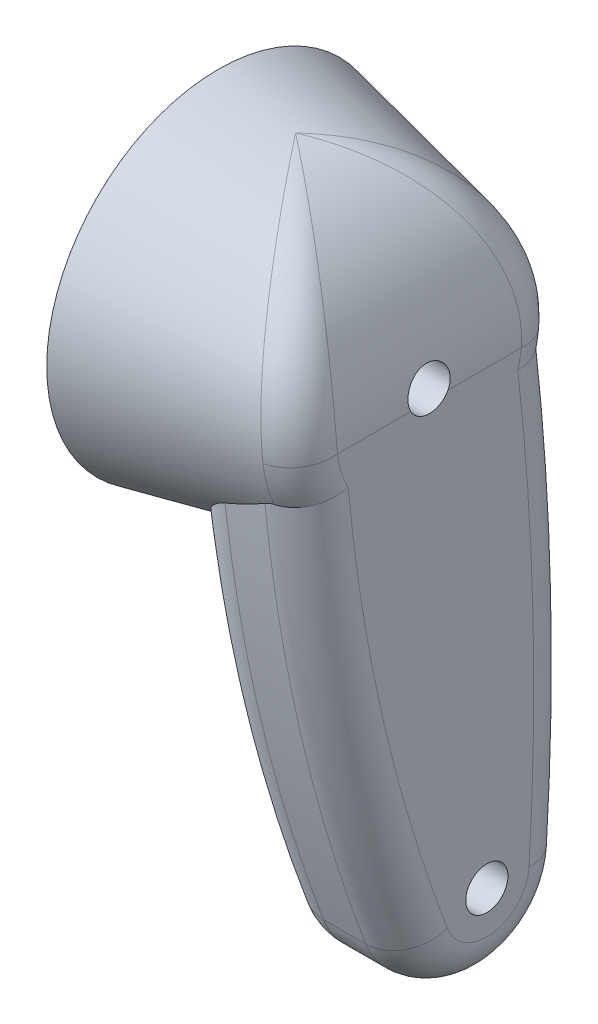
ISO-10303-21;
HEADER;
FILE_DESCRIPTION(('STEP AP214'),'2;1');
FILE_NAME('part.step','',(''),(''),'','','');
FILE_SCHEMA(('AUTOMOTIVE_DESIGN { 1 0 10303 214 1 1 1 1 }'));
ENDSEC;
DATA;
#1=APPLICATION_CONTEXT('core data for automotive mechanical design processes');
#2=APPLICATION_PROTOCOL_DEFINITION('international standard','automotive_design',2000,#1);
#3=PRODUCT_CONTEXT('',#1,'mechanical');
#4=PRODUCT('Part','Part','',(#3));
#5=PRODUCT_RELATED_PRODUCT_CATEGORY('part','',(#4));
#6=PRODUCT_DEFINITION_FORMATION('','',#4);
#7=PRODUCT_DEFINITION_CONTEXT('part definition',#1,'design');
#8=PRODUCT_DEFINITION('design','',#6,#7);
#9=PRODUCT_DEFINITION_SHAPE('','',#8);
#10=(LENGTH_UNIT() NAMED_UNIT(*) SI_UNIT(.MILLI.,.METRE.));
#11=(NAMED_UNIT(*) PLANE_ANGLE_UNIT() SI_UNIT($,.RADIAN.));
#12=(NAMED_UNIT(*) SI_UNIT($,.STERADIAN.) SOLID_ANGLE_UNIT());
#13=UNCERTAINTY_MEASURE_WITH_UNIT(LENGTH_MEASURE(1.E-05),#10,'distance_accuracy_value','');
#14=(GEOMETRIC_REPRESENTATION_CONTEXT(3) GLOBAL_UNCERTAINTY_ASSIGNED_CONTEXT((#13)) GLOBAL_UNIT_ASSIGNED_CONTEXT((#10,
#11,#12)) REPRESENTATION_CONTEXT('',''));
#15=CARTESIAN_POINT('',(0.,0.,0.));
#16=DIRECTION('',(0.,0.,1.));
#17=DIRECTION('',(1.,0.,0.));
#18=AXIS2_PLACEMENT_3D('',#15,#16,#17);
#19=CARTESIAN_POINT('',(292.1,256.100872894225,-943.602671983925));
#20=DIRECTION('',(-1.,0.,0.));
#21=DIRECTION('',(0.,0.,1.));
#22=AXIS2_PLACEMENT_3D('',#19,#20,#21);
#23=CYLINDRICAL_SURFACE('',#22,1016.);
#24=CARTESIAN_POINT('',(292.099999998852,187.624514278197,70.0871170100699));
#25=CARTESIAN_POINT('',(292.100022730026,187.317403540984,70.06637150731));
#26=CARTESIAN_POINT('',(292.091886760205,187.010361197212,70.0454897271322));
#27=CARTESIAN_POINT('',(292.059496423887,186.397188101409,70.0035092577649));
#28=CARTESIAN_POINT('',(292.035244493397,186.09105721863,69.9824106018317));
#29=CARTESIAN_POINT('',(291.938763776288,185.176517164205,69.9189647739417));
#30=CARTESIAN_POINT('',(291.842808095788,184.570482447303,69.8763678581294));
#31=CARTESIAN_POINT('',(291.594117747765,183.383048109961,69.7918541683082));
#32=CARTESIAN_POINT('',(291.442551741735,182.801398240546,69.7499407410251));
#33=CARTESIAN_POINT('',(291.087887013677,181.653801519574,69.6662779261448));
#34=CARTESIAN_POINT('',(290.884759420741,181.087863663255,69.624528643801));
#35=CARTESIAN_POINT('',(290.367967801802,179.813743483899,69.5294968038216));
#36=CARTESIAN_POINT('',(290.03932117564,179.111638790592,69.4763625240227));
#37=CARTESIAN_POINT('',(289.31977819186,177.740180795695,69.3712050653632));
#38=CARTESIAN_POINT('',(288.928861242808,177.070838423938,69.3191822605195));
#39=CARTESIAN_POINT('',(288.093038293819,175.75935267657,69.2160069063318));
#40=CARTESIAN_POINT('',(287.647724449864,175.117470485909,69.1648646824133));
#41=CARTESIAN_POINT('',(286.715462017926,173.864932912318,69.0639290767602));
#42=CARTESIAN_POINT('',(286.228517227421,173.254274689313,69.0141355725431));
#43=CARTESIAN_POINT('',(285.110230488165,171.930813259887,68.9050730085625));
#44=CARTESIAN_POINT('',(284.470640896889,171.224978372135,68.8461207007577));
#45=CARTESIAN_POINT('',(283.151797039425,169.851005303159,68.7299984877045));
#46=CARTESIAN_POINT('',(282.472526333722,169.182882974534,68.6728293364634));
#47=CARTESIAN_POINT('',(281.081504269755,167.879132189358,68.5600388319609));
#48=CARTESIAN_POINT('',(280.36970364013,167.243556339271,68.5044200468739));
#49=CARTESIAN_POINT('',(278.920807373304,166.002129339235,68.394662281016));
#50=CARTESIAN_POINT('',(278.183715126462,165.396274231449,68.3405231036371));
#51=CARTESIAN_POINT('',(276.682067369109,164.205431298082,68.2330796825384));
#52=CARTESIAN_POINT('',(275.917325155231,163.620678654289,68.17978724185));
#53=CARTESIAN_POINT('',(274.370314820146,162.474757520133,68.0743918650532));
#54=CARTESIAN_POINT('',(273.588046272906,161.913589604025,68.0222889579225));
#55=CARTESIAN_POINT('',(272.009595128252,160.812785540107,67.9191941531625));
#56=CARTESIAN_POINT('',(271.213426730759,160.273129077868,67.8682012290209));
#57=CARTESIAN_POINT('',(269.608670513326,159.212567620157,67.7671614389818));
#58=CARTESIAN_POINT('',(268.800082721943,158.691662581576,67.7171145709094));
#59=CARTESIAN_POINT('',(266.938254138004,157.519341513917,67.6035984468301));
#60=CARTESIAN_POINT('',(265.881512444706,156.873461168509,67.5404070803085));
#61=CARTESIAN_POINT('',(263.753353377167,155.606167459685,67.415240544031));
#62=CARTESIAN_POINT('',(262.681935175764,154.984755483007,67.3532654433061));
#63=CARTESIAN_POINT('',(260.526537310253,153.763464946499,67.2303664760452));
#64=CARTESIAN_POINT('',(259.442554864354,153.163591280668,67.1694428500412));
#65=CARTESIAN_POINT('',(257.264103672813,151.983154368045,67.0485302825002));
#66=CARTESIAN_POINT('',(256.169635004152,151.402590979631,66.9885413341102));
#67=CARTESIAN_POINT('',(253.96980975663,150.257797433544,66.8692846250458));
#68=CARTESIAN_POINT('',(252.864437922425,149.693596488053,66.8100182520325));
#69=CARTESIAN_POINT('',(250.64580209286,148.580822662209,66.6922116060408));
#70=CARTESIAN_POINT('',(249.532537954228,148.032250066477,66.6336713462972));
#71=CARTESIAN_POINT('',(247.299072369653,146.949247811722,66.5172314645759));
#72=CARTESIAN_POINT('',(246.178870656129,146.414818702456,66.4593318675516));
#73=CARTESIAN_POINT('',(243.932378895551,145.358848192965,66.3441018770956));
#74=CARTESIAN_POINT('',(242.806088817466,144.837306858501,66.2867714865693));
#75=CARTESIAN_POINT('',(240.615748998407,143.836900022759,66.1760355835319));
#76=CARTESIAN_POINT('',(239.552013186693,143.357349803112,66.1226007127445));
#77=CARTESIAN_POINT('',(237.420289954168,142.407876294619,66.0161326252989));
#78=CARTESIAN_POINT('',(236.352302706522,141.93795261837,65.963099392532));
#79=CARTESIAN_POINT('',(233.142406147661,140.541436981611,65.8045280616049));
#80=CARTESIAN_POINT('',(230.994673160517,139.628150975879,65.6995239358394));
#81=CARTESIAN_POINT('',(226.695017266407,137.835796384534,65.49107095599));
#82=CARTESIAN_POINT('',(224.543145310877,136.956605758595,65.3876175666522));
#83=CARTESIAN_POINT('',(221.307449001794,135.657787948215,65.2331189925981));
#84=CARTESIAN_POINT('',(220.22762650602,135.228199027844,65.1817357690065));
#85=CARTESIAN_POINT('',(218.065514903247,134.375259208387,65.079170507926));
#86=CARTESIAN_POINT('',(216.983225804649,133.951908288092,65.0279884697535));
#87=CARTESIAN_POINT('',(215.8998,133.531474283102,64.9768947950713));
#88=B_SPLINE_CURVE_WITH_KNOTS('',3,(#24,#25,#26,#27,#28,#29,#30,#31,#32,#33,#34,#35,#36,#37,#38,
#39,#40,#41,#42,#43,#44,#45,#46,#47,#48,#49,#50,#51,#52,#53,#54,#55,#56,#57,#58,#59,#60,#61,#62,
#63,#64,#65,#66,#67,#68,#69,#70,#71,#72,#73,#74,#75,#76,#77,#78,#79,#80,#81,#82,#83,#84,#85,#86,
#87),.UNSPECIFIED.,.F.,.F.,(4,2,2,2,2,2,2,2,2,2,2,2,2,2,2,2,2,2,2,2,2,2,2,2,2,2,2,2,2,2,2,4),
(0.,0.923209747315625,1.84627997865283,3.68799790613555,5.49304254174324,7.29910011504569,
9.62631187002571,11.954294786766,14.3009479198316,16.6473872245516,19.5084097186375,
22.3706260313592,25.2373314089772,28.1036539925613,30.9956201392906,33.8876566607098,
36.776894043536,39.6661247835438,43.3860356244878,47.1061569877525,50.8271183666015,
54.5480524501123,58.2752649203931,62.0025452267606,65.7299702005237,69.4574141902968,
72.9615337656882,76.465512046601,83.4738352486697,90.4541815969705,93.9439833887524,
97.4337733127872),.UNSPECIFIED.);
#89=CARTESIAN_POINT('',(266.7,157.37888368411,67.5896780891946));
#90=VERTEX_POINT('',#89);
#91=CARTESIAN_POINT('',(241.3,144.149686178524,66.2106433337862));
#92=VERTEX_POINT('',#91);
#93=EDGE_CURVE('E161',#90,#92,#88,.T.);
#94=ORIENTED_EDGE('',*,*,#93,.T.);
#95=CARTESIAN_POINT('',(241.3,256.100872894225,-943.602671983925));
#96=DIRECTION('',(1.,0.,0.));
#97=DIRECTION('',(0.,0.,-1.));
#98=AXIS2_PLACEMENT_3D('',#95,#96,#97);
#99=CIRCLE('',#98,1016.);
#100=CARTESIAN_POINT('',(241.3,-102.421094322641,7.03816399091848));
#101=VERTEX_POINT('',#100);
#102=EDGE_CURVE('E234',#92,#101,#99,.T.);
#103=ORIENTED_EDGE('',*,*,#102,.T.);
#104=DIRECTION('',(-1.,0.,0.));
#105=VECTOR('',#104,1.);
#106=CARTESIAN_POINT('',(292.1,-102.421094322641,7.03816399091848));
#107=LINE('',#106,#105);
#108=CARTESIAN_POINT('',(266.7,-102.421094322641,7.03816399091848));
#109=VERTEX_POINT('',#108);
#110=EDGE_CURVE('E375',#109,#101,#107,.T.);
#111=ORIENTED_EDGE('',*,*,#110,.F.);
#112=CARTESIAN_POINT('',(266.7,256.100872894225,-943.602671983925));
#113=DIRECTION('',(1.,0.,0.));
#114=DIRECTION('',(0.,0.,-1.));
#115=AXIS2_PLACEMENT_3D('',#112,#113,#114);
#116=CIRCLE('',#115,1016.);
#117=EDGE_CURVE('E397',#109,#90,#116,.F.);
#118=ORIENTED_EDGE('',*,*,#117,.T.);
#119=EDGE_LOOP('',(#94,#103,#111,#118));
#120=FACE_BOUND('',#119,.T.);
#121=ADVANCED_FACE('F31',(#120),#23,.T.);
#122=CARTESIAN_POINT('',(292.1,-84.4949959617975,-40.4938778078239));
#123=DIRECTION('',(-1.,0.,0.));
#124=DIRECTION('',(0.,0.,1.));
#125=AXIS2_PLACEMENT_3D('',#122,#123,#124);
#126=CYLINDRICAL_SURFACE('',#125,50.8000000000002);
#127=ORIENTED_EDGE('',*,*,#110,.T.);
#128=CARTESIAN_POINT('',(241.3,-84.4949959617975,-40.4938778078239));
#129=DIRECTION('',(1.,0.,0.));
#130=DIRECTION('',(0.,0.,-1.));
#131=AXIS2_PLACEMENT_3D('',#128,#129,#130);
#132=CIRCLE('',#131,50.8000000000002);
#133=CARTESIAN_POINT('',(241.3,-87.6442779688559,-91.1961659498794));
#134=VERTEX_POINT('',#133);
#135=EDGE_CURVE('E359',#101,#134,#132,.T.);
#136=ORIENTED_EDGE('',*,*,#135,.T.);
#137=DIRECTION('',(-1.,0.,0.));
#138=VECTOR('',#137,1.);
#139=CARTESIAN_POINT('',(292.1,-87.6442779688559,-91.1961659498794));
#140=LINE('',#139,#138);
#141=CARTESIAN_POINT('',(266.7,-87.6442779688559,-91.1961659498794));
#142=VERTEX_POINT('',#141);
#143=EDGE_CURVE('E380',#142,#134,#140,.T.);
#144=ORIENTED_EDGE('',*,*,#143,.F.);
#145=CARTESIAN_POINT('',(266.7,-84.4949959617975,-40.4938778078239));
#146=DIRECTION('',(1.,0.,0.));
#147=DIRECTION('',(0.,0.,-1.));
#148=AXIS2_PLACEMENT_3D('',#145,#146,#147);
#149=CIRCLE('',#148,50.8000000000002);
#150=EDGE_CURVE('E378',#142,#109,#149,.F.);
#151=ORIENTED_EDGE('',*,*,#150,.T.);
#152=EDGE_LOOP('',(#127,#136,#144,#151));
#153=FACE_BOUND('',#152,.T.);
#154=ADVANCED_FACE('F306',(#153),#126,.T.);
#155=CARTESIAN_POINT('',(292.1,6.83418224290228,1429.87247831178));
#156=DIRECTION('',(-1.,0.,0.));
#157=DIRECTION('',(0.,0.,1.));
#158=AXIS2_PLACEMENT_3D('',#155,#156,#157);
#159=CYLINDRICAL_SURFACE('',#158,1524.);
#160=ORIENTED_EDGE('',*,*,#143,.T.);
#161=CARTESIAN_POINT('',(241.3,6.83418224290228,1429.87247831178));
#162=DIRECTION('',(1.,0.,0.));
#163=DIRECTION('',(0.,0.,-1.));
#164=AXIS2_PLACEMENT_3D('',#161,#162,#163);
#165=CIRCLE('',#164,1524.);
#166=CARTESIAN_POINT('',(241.3,159.759376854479,-86.4354999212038));
#167=VERTEX_POINT('',#166);
#168=EDGE_CURVE('E365',#134,#167,#165,.T.);
#169=ORIENTED_EDGE('',*,*,#168,.T.);
#170=CARTESIAN_POINT('',(215.8998,149.262670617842,-87.4574547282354));
#171=CARTESIAN_POINT('',(217.071458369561,149.712553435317,-87.4152249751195));
#172=CARTESIAN_POINT('',(218.241814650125,150.165768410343,-87.3724811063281));
#173=CARTESIAN_POINT('',(220.579689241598,151.079370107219,-87.2858972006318));
#174=CARTESIAN_POINT('',(221.747207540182,151.53975686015,-87.2420571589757));
#175=CARTESIAN_POINT('',(225.245508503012,152.932576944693,-87.1087773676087));
#176=CARTESIAN_POINT('',(227.571666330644,153.876528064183,-87.0175912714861));
#177=CARTESIAN_POINT('',(231.055881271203,155.321771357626,-86.876568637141));
#178=CARTESIAN_POINT('',(232.219554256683,155.809749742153,-86.8287201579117));
#179=CARTESIAN_POINT('',(234.542681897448,156.795474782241,-86.7315755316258));
#180=CARTESIAN_POINT('',(235.702136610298,157.293221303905,-86.6822794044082));
#181=CARTESIAN_POINT('',(238.016267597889,158.299285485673,-86.5821296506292));
#182=CARTESIAN_POINT('',(239.170944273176,158.807602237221,-86.5312761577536));
#183=CARTESIAN_POINT('',(241.475120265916,159.835837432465,-86.4278746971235));
#184=CARTESIAN_POINT('',(242.624619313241,160.355756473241,-86.3753266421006));
#185=CARTESIAN_POINT('',(244.931216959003,161.414464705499,-86.2677601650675));
#186=CARTESIAN_POINT('',(246.088245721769,161.953403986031,-86.2127199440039));
#187=CARTESIAN_POINT('',(248.395440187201,163.045564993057,-86.1005772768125));
#188=CARTESIAN_POINT('',(249.545605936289,163.598786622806,-86.0434748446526));
#189=CARTESIAN_POINT('',(251.838031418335,164.721006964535,-85.9270034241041));
#190=CARTESIAN_POINT('',(252.980291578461,165.290004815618,-85.8676345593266));
#191=CARTESIAN_POINT('',(255.255735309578,166.44557223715,-85.7463859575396));
#192=CARTESIAN_POINT('',(256.388919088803,167.032141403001,-85.6845062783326));
#193=CARTESIAN_POINT('',(258.642418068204,168.223732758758,-85.5580780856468));
#194=CARTESIAN_POINT('',(259.762754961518,168.828714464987,-85.4935353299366));
#195=CARTESIAN_POINT('',(261.991084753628,170.060768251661,-85.3613206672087));
#196=CARTESIAN_POINT('',(263.099077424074,170.68784073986,-85.2936487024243));
#197=CARTESIAN_POINT('',(265.299916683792,171.966806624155,-85.1547920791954));
#198=CARTESIAN_POINT('',(266.392768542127,172.618691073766,-85.0836086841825));
#199=CARTESIAN_POINT('',(268.560588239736,173.951036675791,-84.9372148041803));
#200=CARTESIAN_POINT('',(269.635557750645,174.631495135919,-84.862004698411));
#201=CARTESIAN_POINT('',(271.154709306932,175.626613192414,-84.751305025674));
#202=CARTESIAN_POINT('',(271.607879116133,175.927798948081,-84.7177113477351));
#203=CARTESIAN_POINT('',(272.50978932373,176.536626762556,-84.6496159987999));
#204=CARTESIAN_POINT('',(272.958529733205,176.84426880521,-84.6151143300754));
#205=CARTESIAN_POINT('',(274.297581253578,177.777606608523,-84.5101477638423));
#206=CARTESIAN_POINT('',(275.180620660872,178.413647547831,-84.4382286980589));
#207=CARTESIAN_POINT('',(276.92540854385,179.719214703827,-84.2897318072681));
#208=CARTESIAN_POINT('',(277.787085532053,180.388835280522,-84.2131407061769));
#209=CARTESIAN_POINT('',(279.480307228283,181.764627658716,-84.0548049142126));
#210=CARTESIAN_POINT('',(280.311854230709,182.470796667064,-83.9730606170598));
#211=CARTESIAN_POINT('',(281.946951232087,183.934793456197,-83.8024946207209));
#212=CARTESIAN_POINT('',(282.750011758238,184.693163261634,-83.713596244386));
#213=CARTESIAN_POINT('',(284.305140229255,186.260731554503,-83.5285712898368));
#214=CARTESIAN_POINT('',(285.057184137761,187.069953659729,-83.4324413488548));
#215=CARTESIAN_POINT('',(286.489716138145,188.743052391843,-83.2322336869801));
#216=CARTESIAN_POINT('',(287.170519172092,189.60665885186,-83.1281947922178));
#217=CARTESIAN_POINT('',(288.122155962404,190.94961065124,-82.9651572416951));
#218=CARTESIAN_POINT('',(288.427631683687,191.404933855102,-82.90967909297));
#219=CARTESIAN_POINT('',(289.011839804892,192.332312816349,-82.7962434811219));
#220=CARTESIAN_POINT('',(289.290569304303,192.804370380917,-82.7382857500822));
#221=CARTESIAN_POINT('',(289.817919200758,193.767136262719,-82.6196065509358));
#222=CARTESIAN_POINT('',(290.066420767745,194.257908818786,-82.5588753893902));
#223=CARTESIAN_POINT('',(290.527134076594,195.255750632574,-82.4348863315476));
#224=CARTESIAN_POINT('',(290.739361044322,195.762812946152,-82.3716295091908));
#225=CARTESIAN_POINT('',(291.122066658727,196.79077293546,-82.2428483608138));
#226=CARTESIAN_POINT('',(291.292652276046,197.311631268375,-82.177330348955));
#227=CARTESIAN_POINT('',(291.587822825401,198.365770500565,-82.0441638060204));
#228=CARTESIAN_POINT('',(291.712430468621,198.899045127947,-81.9765163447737));
#229=CARTESIAN_POINT('',(291.906812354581,199.948844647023,-81.8427704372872));
#230=CARTESIAN_POINT('',(291.978940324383,200.464937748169,-81.7767545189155));
#231=CARTESIAN_POINT('',(292.051411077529,201.242805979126,-81.676844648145));
#232=CARTESIAN_POINT('',(292.069614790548,201.503065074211,-81.6433485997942));
#233=CARTESIAN_POINT('',(292.093917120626,202.024149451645,-81.5761466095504));
#234=CARTESIAN_POINT('',(292.100014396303,202.284974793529,-81.5424406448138));
#235=CARTESIAN_POINT('',(292.099999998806,202.545828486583,-81.5086620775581));
#236=B_SPLINE_CURVE_WITH_KNOTS('',3,(#170,#171,#172,#173,#174,#175,#176,#177,#178,#179,#180,
#181,#182,#183,#184,#185,#186,#187,#188,#189,#190,#191,#192,#193,#194,#195,#196,#197,#198,#199,
#200,#201,#202,#203,#204,#205,#206,#207,#208,#209,#210,#211,#212,#213,#214,#215,#216,#217,#218,
#219,#220,#221,#222,#223,#224,#225,#226,#227,#228,#229,#230,#231,#232,#233,#234,#235),
.UNSPECIFIED.,.F.,.F.,(4,2,2,2,2,2,2,2,2,2,2,2,2,2,2,2,2,2,2,2,2,2,2,2,2,2,2,2,2,2,2,2,4),(0.,
3.76729869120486,7.53461371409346,15.0704358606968,18.8586619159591,22.6468360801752,
26.4346859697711,30.2227312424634,34.0553693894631,37.8879815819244,41.7203850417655,
45.5527003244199,49.3771244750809,53.2016192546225,57.0247478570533,60.8475170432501,
62.4829614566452,64.1184017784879,67.389648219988,70.6706674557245,73.9514363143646,
77.2738569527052,80.5978322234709,83.9064298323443,85.5589972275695,87.2117436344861,
88.8707905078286,90.5291392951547,92.1831821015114,93.8364067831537,95.4099363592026,
96.1988000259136,96.9877510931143),.UNSPECIFIED.);
#237=CARTESIAN_POINT('',(266.699999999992,172.81085513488,-85.0624193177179));
#238=VERTEX_POINT('',#237);
#239=EDGE_CURVE('E143',#167,#238,#236,.T.);
#240=ORIENTED_EDGE('',*,*,#239,.T.);
#241=CARTESIAN_POINT('',(266.7,6.83418224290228,1429.87247831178));
#242=DIRECTION('',(1.,0.,0.));
#243=DIRECTION('',(0.,0.,-1.));
#244=AXIS2_PLACEMENT_3D('',#241,#242,#243);
#245=CIRCLE('',#244,1524.);
#246=EDGE_CURVE('E395',#238,#142,#245,.F.);
#247=ORIENTED_EDGE('',*,*,#246,.T.);
#248=EDGE_LOOP('',(#160,#169,#240,#247));
#249=FACE_BOUND('',#248,.T.);
#250=ADVANCED_FACE('F167',(#249),#159,.T.);
#251=CARTESIAN_POINT('',(292.1,85.8029384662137,-492.048274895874));
#252=DIRECTION('',(1.,0.,0.));
#253=DIRECTION('',(0.,0.,-1.));
#254=AXIS2_PLACEMENT_3D('',#251,#252,#253);
#255=PLANE('',#254);
#256=CARTESIAN_POINT('',(292.1,-84.4949959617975,-40.4938778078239));
#257=DIRECTION('',(1.,0.,0.));
#258=DIRECTION('',(0.,0.,-1.));
#259=AXIS2_PLACEMENT_3D('',#256,#257,#258);
#260=CIRCLE('',#259,12.7);
#261=CARTESIAN_POINT('',(292.1,-84.4949959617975,-53.1938778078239));
#262=VERTEX_POINT('',#261);
#263=EDGE_CURVE('E346',#262,#262,#260,.T.);
#264=ORIENTED_EDGE('',*,*,#263,.F.);
#265=EDGE_LOOP('',(#264));
#266=FACE_BOUND('',#265,.T.);
#267=CARTESIAN_POINT('',(292.1,192.760056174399,-5.93962966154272));
#268=DIRECTION('',(1.,0.,0.));
#269=DIRECTION('',(0.,0.,-1.));
#270=AXIS2_PLACEMENT_3D('',#267,#268,#269);
#271=CIRCLE('',#270,12.7);
#272=CARTESIAN_POINT('',(292.1,186.685998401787,5.21365784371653));
#273=VERTEX_POINT('',#272);
#274=CARTESIAN_POINT('',(292.1,186.685998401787,-17.0929171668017));
#275=VERTEX_POINT('',#274);
#276=EDGE_CURVE('E47',#273,#275,#271,.T.);
#277=ORIENTED_EDGE('',*,*,#276,.F.);
#278=DIRECTION('',(0.,0.,-1.));
#279=VECTOR('',#278,1.);
#280=CARTESIAN_POINT('',(292.1,186.685998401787,705.950796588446));
#281=LINE('',#280,#279);
#282=CARTESIAN_POINT('',(292.1,186.685998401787,49.3592673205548));
#283=VERTEX_POINT('',#282);
#284=EDGE_CURVE('E130',#283,#273,#281,.T.);
#285=ORIENTED_EDGE('',*,*,#284,.F.);
#286=CARTESIAN_POINT('',(292.1,192.760056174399,-5.93962966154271));
#287=DIRECTION('',(1.,0.,0.));
#288=DIRECTION('',(0.,0.,-1.));
#289=AXIS2_PLACEMENT_3D('',#286,#287,#288);
#290=CIRCLE('',#289,55.6314855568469);
#291=CARTESIAN_POINT('',(292.1,166.127929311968,42.9028928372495));
#292=VERTEX_POINT('',#291);
#293=EDGE_CURVE('E393',#283,#292,#290,.T.);
#294=ORIENTED_EDGE('',*,*,#293,.T.);
#295=CARTESIAN_POINT('',(292.1,256.100872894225,-943.602671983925));
#296=DIRECTION('',(1.,0.,0.));
#297=DIRECTION('',(0.,0.,-1.));
#298=AXIS2_PLACEMENT_3D('',#295,#296,#297);
#299=CIRCLE('',#298,990.6);
#300=CARTESIAN_POINT('',(292.1,-93.4580451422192,-16.7278569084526));
#301=VERTEX_POINT('',#300);
#302=EDGE_CURVE('E391',#292,#301,#299,.T.);
#303=ORIENTED_EDGE('',*,*,#302,.T.);
#304=CARTESIAN_POINT('',(292.1,-84.4949959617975,-40.4938778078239));
#305=DIRECTION('',(1.,0.,0.));
#306=DIRECTION('',(0.,0.,-1.));
#307=AXIS2_PLACEMENT_3D('',#304,#305,#306);
#308=CIRCLE('',#307,25.4000000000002);
#309=CARTESIAN_POINT('',(292.1,-86.0696369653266,-65.8450218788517));
#310=VERTEX_POINT('',#309);
#311=EDGE_CURVE('E389',#301,#310,#308,.T.);
#312=ORIENTED_EDGE('',*,*,#311,.T.);
#313=CARTESIAN_POINT('',(292.1,6.83418224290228,1429.87247831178));
#314=DIRECTION('',(1.,0.,0.));
#315=DIRECTION('',(0.,0.,-1.));
#316=AXIS2_PLACEMENT_3D('',#313,#314,#315);
#317=CIRCLE('',#316,1498.6);
#318=CARTESIAN_POINT('',(292.1,176.381801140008,-59.1055487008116));
#319=VERTEX_POINT('',#318);
#320=EDGE_CURVE('E386',#310,#319,#317,.T.);
#321=ORIENTED_EDGE('',*,*,#320,.T.);
#322=CARTESIAN_POINT('',(292.1,192.760056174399,-5.93962966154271));
#323=DIRECTION('',(1.,0.,0.));
#324=DIRECTION('',(0.,0.,-1.));
#325=AXIS2_PLACEMENT_3D('',#322,#323,#324);
#326=CIRCLE('',#325,55.6314855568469);
#327=CARTESIAN_POINT('',(292.1,186.685998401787,-61.2385266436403));
#328=VERTEX_POINT('',#327);
#329=EDGE_CURVE('E382',#319,#328,#326,.T.);
#330=ORIENTED_EDGE('',*,*,#329,.T.);
#331=EDGE_CURVE('E133',#275,#328,#281,.T.);
#332=ORIENTED_EDGE('',*,*,#331,.F.);
#333=EDGE_LOOP('',(#277,#285,#294,#303,#312,#321,#330,#332));
#334=FACE_BOUND('',#333,.T.);
#335=ADVANCED_FACE('F129',(#266,#334),#255,.T.);
#336=CARTESIAN_POINT('',(215.9,85.8029384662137,-492.048274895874));
#337=DIRECTION('',(1.,0.,0.));
#338=DIRECTION('',(0.,0.,-1.));
#339=AXIS2_PLACEMENT_3D('',#336,#337,#338);
#340=PLANE('',#339);
#341=CARTESIAN_POINT('',(215.9,-84.4949959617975,-40.4938778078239));
#342=DIRECTION('',(1.,0.,0.));
#343=DIRECTION('',(0.,0.,-1.));
#344=AXIS2_PLACEMENT_3D('',#341,#342,#343);
#345=CIRCLE('',#344,12.7);
#346=CARTESIAN_POINT('',(215.9,-84.4949959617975,-53.1938778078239));
#347=VERTEX_POINT('',#346);
#348=EDGE_CURVE('E36',#347,#347,#345,.T.);
#349=ORIENTED_EDGE('',*,*,#348,.T.);
#350=EDGE_LOOP('',(#349));
#351=FACE_BOUND('',#350,.T.);
#352=CARTESIAN_POINT('',(215.9,192.760056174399,-5.93962966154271));
#353=DIRECTION('',(1.,0.,0.));
#354=DIRECTION('',(0.,0.,-1.));
#355=AXIS2_PLACEMENT_3D('',#352,#353,#354);
#356=CIRCLE('',#355,92.3968099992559);
#357=CARTESIAN_POINT('',(215.9,110.556223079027,36.246864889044));
#358=VERTEX_POINT('',#357);
#359=CARTESIAN_POINT('',(215.9,121.175586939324,-64.3590978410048));
#360=VERTEX_POINT('',#359);
#361=EDGE_CURVE('E379',#358,#360,#356,.T.);
#362=ORIENTED_EDGE('',*,*,#361,.T.);
#363=CARTESIAN_POINT('',(215.9,6.83418224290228,1429.87247831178));
#364=DIRECTION('',(1.,0.,0.));
#365=DIRECTION('',(0.,0.,-1.));
#366=AXIS2_PLACEMENT_3D('',#363,#364,#365);
#367=CIRCLE('',#366,1498.6);
#368=CARTESIAN_POINT('',(215.9,-86.0696369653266,-65.8450218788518));
#369=VERTEX_POINT('',#368);
#370=EDGE_CURVE('E367',#360,#369,#367,.F.);
#371=ORIENTED_EDGE('',*,*,#370,.T.);
#372=CARTESIAN_POINT('',(215.9,-84.4949959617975,-40.4938778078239));
#373=DIRECTION('',(1.,0.,0.));
#374=DIRECTION('',(0.,0.,-1.));
#375=AXIS2_PLACEMENT_3D('',#372,#373,#374);
#376=CIRCLE('',#375,25.4000000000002);
#377=CARTESIAN_POINT('',(215.9,-93.4580451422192,-16.7278569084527));
#378=VERTEX_POINT('',#377);
#379=EDGE_CURVE('E358',#369,#378,#376,.F.);
#380=ORIENTED_EDGE('',*,*,#379,.T.);
#381=CARTESIAN_POINT('',(215.9,256.100872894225,-943.602671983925));
#382=DIRECTION('',(1.,0.,0.));
#383=DIRECTION('',(0.,0.,-1.));
#384=AXIS2_PLACEMENT_3D('',#381,#382,#383);
#385=CIRCLE('',#384,990.6);
#386=EDGE_CURVE('E362',#378,#358,#385,.F.);
#387=ORIENTED_EDGE('',*,*,#386,.T.);
#388=EDGE_LOOP('',(#362,#371,#380,#387));
#389=FACE_BOUND('',#388,.T.);
#390=ADVANCED_FACE('F177',(#351,#389),#340,.F.);
#391=CARTESIAN_POINT('',(292.1,192.760056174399,-5.93962966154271));
#392=DIRECTION('',(-1.,0.,0.));
#393=DIRECTION('',(0.,0.,-1.));
#394=AXIS2_PLACEMENT_3D('',#391,#392,#393);
#395=CONICAL_SURFACE('',#394,76.2000000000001,0.20943951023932);
#396=CARTESIAN_POINT('',(266.7,157.37888368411,67.5896780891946));
#397=CARTESIAN_POINT('',(266.947537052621,157.531087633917,67.6045310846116));
#398=CARTESIAN_POINT('',(267.199172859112,157.677398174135,67.6151506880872));
#399=CARTESIAN_POINT('',(267.711123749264,157.955785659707,67.6269189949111));
#400=CARTESIAN_POINT('',(267.971457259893,158.087829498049,67.6280461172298));
#401=CARTESIAN_POINT('',(268.493529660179,158.331426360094,67.6198525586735));
#402=CARTESIAN_POINT('',(268.75506957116,158.443410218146,67.6107931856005));
#403=CARTESIAN_POINT('',(269.285037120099,158.647867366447,67.5816780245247));
#404=CARTESIAN_POINT('',(269.553461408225,158.740349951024,67.5616274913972));
#405=CARTESIAN_POINT('',(269.999803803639,158.874129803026,67.5189157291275));
#406=CARTESIAN_POINT('',(270.176113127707,158.921955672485,67.4996930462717));
#407=CARTESIAN_POINT('',(270.53053937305,159.007566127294,67.4561669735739));
#408=CARTESIAN_POINT('',(270.708656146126,159.045351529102,67.4318639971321));
#409=CARTESIAN_POINT('',(271.068908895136,159.110785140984,67.3776511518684));
#410=CARTESIAN_POINT('',(271.251063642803,159.138261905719,67.3476579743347));
#411=CARTESIAN_POINT('',(271.615864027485,159.181826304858,67.2823297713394));
#412=CARTESIAN_POINT('',(271.798509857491,159.197908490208,67.2469921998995));
#413=CARTESIAN_POINT('',(271.980956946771,159.20808449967,67.2089979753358));
#414=B_SPLINE_CURVE_WITH_KNOTS('',3,(#396,#397,#398,#399,#400,#401,#402,#403,#404,#405,#406,
#407,#408,#409,#410,#411,#412,#413),.UNSPECIFIED.,.F.,.F.,(4,2,2,2,2,2,2,2,4),(0.,
0.873065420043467,1.74811520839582,2.6012199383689,3.45391715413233,4.00467294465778,
4.55538393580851,5.11488577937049,5.67465500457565),.UNSPECIFIED.);
#415=CARTESIAN_POINT('',(271.980956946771,159.20808449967,67.2089979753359));
#416=VERTEX_POINT('',#415);
#417=EDGE_CURVE('E221',#90,#416,#414,.T.);
#418=ORIENTED_EDGE('',*,*,#417,.T.);
#419=CARTESIAN_POINT('',(271.980956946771,192.760056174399,-5.93962966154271));
#420=DIRECTION('',(1.,0.,0.));
#421=DIRECTION('',(0.,0.,-1.));
#422=AXIS2_PLACEMENT_3D('',#419,#420,#421);
#423=CIRCLE('',#422,80.4764346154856);
#424=CARTESIAN_POINT('',(271.980956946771,183.973332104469,74.0556827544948));
#425=VERTEX_POINT('',#424);
#426=EDGE_CURVE('E321',#416,#425,#423,.F.);
#427=ORIENTED_EDGE('',*,*,#426,.T.);
#428=CARTESIAN_POINT('',(289.552525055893,164.077210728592,45.1465872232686));
#429=CARTESIAN_POINT('',(288.040530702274,157.452934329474,62.6751985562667));
#430=CARTESIAN_POINT('',(270.070350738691,159.518490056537,67.796281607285));
#431=CARTESIAN_POINT('',(289.752865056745,164.954866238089,45.4083143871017));
#432=CARTESIAN_POINT('',(288.33037448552,158.451582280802,63.1132041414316));
#433=CARTESIAN_POINT('',(270.2206057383,160.462747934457,68.1869583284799));
#434=CARTESIAN_POINT('',(289.942694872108,165.840371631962,45.6598053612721));
#435=CARTESIAN_POINT('',(288.607605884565,159.464400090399,63.535459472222));
#436=CARTESIAN_POINT('',(270.362978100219,161.416304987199,68.5624021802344));
#437=CARTESIAN_POINT('',(290.300316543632,167.625956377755,46.1417632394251));
#438=CARTESIAN_POINT('',(289.136022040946,161.521714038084,64.3485308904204));
#439=CARTESIAN_POINT('',(270.631194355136,163.340682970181,69.2818471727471));
#440=CARTESIAN_POINT('',(290.468106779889,168.52603679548,46.3722285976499));
#441=CARTESIAN_POINT('',(289.387010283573,162.565991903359,64.7390800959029));
#442=CARTESIAN_POINT('',(270.757037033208,164.311505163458,69.6258460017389));
#443=CARTESIAN_POINT('',(290.780665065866,170.339882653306,46.8116336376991));
#444=CARTESIAN_POINT('',(289.860502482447,164.684881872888,65.4864317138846));
#445=CARTESIAN_POINT('',(270.991455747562,166.269335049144,70.2814986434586));
#446=CARTESIAN_POINT('',(290.925423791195,171.253653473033,47.0205645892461));
#447=CARTESIAN_POINT('',(290.082799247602,165.759214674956,65.8429531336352));
#448=CARTESIAN_POINT('',(271.100024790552,167.256349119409,70.5931393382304));
#449=CARTESIAN_POINT('',(291.190892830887,173.093058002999,47.4162541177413));
#450=CARTESIAN_POINT('',(290.496364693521,167.93541913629,66.5196758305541));
#451=CARTESIAN_POINT('',(271.299126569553,169.244447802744,71.182970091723));
#452=CARTESIAN_POINT('',(291.311603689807,174.018691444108,47.6030131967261));
#453=CARTESIAN_POINT('',(290.687445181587,169.036929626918,66.8396168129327));
#454=CARTESIAN_POINT('',(271.389659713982,170.245532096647,71.4611609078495));
#455=CARTESIAN_POINT('',(291.636095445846,176.809185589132,48.1288973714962));
#456=CARTESIAN_POINT('',(291.211027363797,172.381054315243,67.7421441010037));
#457=CARTESIAN_POINT('',(271.633028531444,173.265106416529,72.2436667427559));
#458=CARTESIAN_POINT('',(291.802664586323,178.690109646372,48.4342284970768));
#459=CARTESIAN_POINT('',(291.491986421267,174.65391600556,68.2644011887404));
#460=CARTESIAN_POINT('',(271.757955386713,175.302584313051,72.6968098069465));
#461=CARTESIAN_POINT('',(292.030678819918,182.480460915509,48.9513456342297));
#462=CARTESIAN_POINT('',(291.90585619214,179.272592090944,69.1400644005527));
#463=CARTESIAN_POINT('',(271.928966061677,179.411148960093,73.4606746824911));
#464=CARTESIAN_POINT('',(292.092142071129,184.389883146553,49.1631477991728));
#465=CARTESIAN_POINT('',(292.037792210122,181.613980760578,69.4919482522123));
#466=CARTESIAN_POINT('',(271.975063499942,181.482229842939,73.7714210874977));
#467=CARTESIAN_POINT('',(292.106462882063,188.229139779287,49.4921204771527));
#468=CARTESIAN_POINT('',(292.143617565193,186.343106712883,70.0174591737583));
#469=CARTESIAN_POINT('',(271.985804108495,185.647507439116,74.248324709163));
#470=CARTESIAN_POINT('',(292.059013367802,190.159016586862,49.6090221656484));
#471=CARTESIAN_POINT('',(292.1166549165,188.725841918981,70.1896771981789));
#472=CARTESIAN_POINT('',(271.950216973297,187.741752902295,74.4140712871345));
#473=CARTESIAN_POINT('',(291.853452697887,194.019048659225,49.7470571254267));
#474=CARTESIAN_POINT('',(291.900129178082,193.493240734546,70.3507065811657));
#475=CARTESIAN_POINT('',(271.796046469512,191.929688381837,74.5991078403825));
#476=CARTESIAN_POINT('',(291.695334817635,195.949203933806,49.7681845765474));
#477=CARTESIAN_POINT('',(291.710860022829,195.872603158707,70.3393989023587));
#478=CARTESIAN_POINT('',(271.677458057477,194.023378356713,74.6183889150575));
#479=CARTESIAN_POINT('',(291.26949305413,199.793494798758,49.7162331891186));
#480=CARTESIAN_POINT('',(291.173872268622,200.593369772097,70.1378864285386));
#481=CARTESIAN_POINT('',(271.358076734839,198.190704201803,74.5130391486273));
#482=CARTESIAN_POINT('',(291.001856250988,201.707641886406,49.6432290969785));
#483=CARTESIAN_POINT('',(290.827261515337,202.929833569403,69.9484979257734));
#484=CARTESIAN_POINT('',(271.157349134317,200.26435466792,74.3885225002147));
#485=CARTESIAN_POINT('',(290.35998439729,205.507711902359,49.4062561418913));
#486=CARTESIAN_POINT('',(289.98621916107,207.532827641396,69.402582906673));
#487=CARTESIAN_POINT('',(270.675945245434,204.376689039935,74.0009541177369));
#488=CARTESIAN_POINT('',(289.985750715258,207.393635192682,49.2422884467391));
#489=CARTESIAN_POINT('',(289.493293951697,209.795159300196,69.0473618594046));
#490=CARTESIAN_POINT('',(270.395269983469,206.415373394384,73.7379041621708));
#491=CARTESIAN_POINT('',(289.144212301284,211.086667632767,48.8320901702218));
#492=CARTESIAN_POINT('',(288.386557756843,214.17755445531,68.1954866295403));
#493=CARTESIAN_POINT('',(269.764116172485,210.401665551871,73.0874820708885));
#494=CARTESIAN_POINT('',(288.678978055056,212.894599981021,48.5876192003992));
#495=CARTESIAN_POINT('',(287.77721714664,216.29629644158,67.7035497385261));
#496=CARTESIAN_POINT('',(269.415190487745,212.350284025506,72.7027756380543));
#497=CARTESIAN_POINT('',(287.656572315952,216.461883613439,48.0207594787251));
#498=CARTESIAN_POINT('',(286.448752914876,220.422690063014,66.5943108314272));
#499=CARTESIAN_POINT('',(268.648386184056,216.188201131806,71.8161764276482));
#500=CARTESIAN_POINT('',(287.099404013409,218.221236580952,47.6983734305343));
#501=CARTESIAN_POINT('',(285.731375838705,222.428393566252,65.978726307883));
#502=CARTESIAN_POINT('',(268.230509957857,218.077501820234,71.314287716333));
#503=CARTESIAN_POINT('',(285.899205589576,221.684765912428,46.9810762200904));
#504=CARTESIAN_POINT('',(284.203968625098,226.31962076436,64.6411532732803));
#505=CARTESIAN_POINT('',(267.330361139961,221.788846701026,70.2024355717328));
#506=CARTESIAN_POINT('',(285.256114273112,223.388901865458,46.5861132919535));
#507=CARTESIAN_POINT('',(283.395486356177,228.204069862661,63.9207237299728));
#508=CARTESIAN_POINT('',(266.848042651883,223.610841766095,69.5923950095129));
#509=CARTESIAN_POINT('',(283.891098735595,226.735073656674,45.7296193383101));
#510=CARTESIAN_POINT('',(281.702867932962,231.847578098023,62.392177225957));
#511=CARTESIAN_POINT('',(265.824280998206,227.179593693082,68.2742608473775));
#512=CARTESIAN_POINT('',(283.169158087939,228.377096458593,45.268074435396));
#513=CARTESIAN_POINT('',(280.820087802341,233.606409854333,61.5854656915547));
#514=CARTESIAN_POINT('',(265.282825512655,228.926334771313,67.5661468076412));
#515=CARTESIAN_POINT('',(281.871790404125,231.131017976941,44.4260651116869));
#516=CARTESIAN_POINT('',(279.254724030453,236.514694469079,60.1416361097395));
#517=CARTESIAN_POINT('',(264.309799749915,231.847785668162,66.2785378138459));
#518=CARTESIAN_POINT('',(281.314007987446,232.259458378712,44.0605043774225));
#519=CARTESIAN_POINT('',(278.589746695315,237.690978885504,59.5245340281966));
#520=CARTESIAN_POINT('',(263.891462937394,233.042423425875,65.7206927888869));
#521=CARTESIAN_POINT('',(280.164658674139,234.481113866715,43.3008411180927));
#522=CARTESIAN_POINT('',(277.234122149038,239.981361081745,58.2599663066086));
#523=CARTESIAN_POINT('',(263.029450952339,235.389420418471,64.5640039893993));
#524=CARTESIAN_POINT('',(279.573098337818,235.574335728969,42.9067441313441));
#525=CARTESIAN_POINT('',(276.543783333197,241.095727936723,57.6128363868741));
#526=CARTESIAN_POINT('',(262.585780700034,236.541787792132,63.9651681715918));
#527=CARTESIAN_POINT('',(277.750693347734,238.801053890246,41.6842513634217));
#528=CARTESIAN_POINT('',(274.447411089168,244.337857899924,55.6394393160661));
#529=CARTESIAN_POINT('',(261.218976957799,239.935388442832,62.1115940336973));
#530=CARTESIAN_POINT('',(276.472315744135,240.881200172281,40.8157780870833));
#531=CARTESIAN_POINT('',(273.002080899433,246.390246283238,54.2682759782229));
#532=CARTESIAN_POINT('',(260.260193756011,242.112693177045,60.7999793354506));
#533=CARTESIAN_POINT('',(273.805317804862,244.897748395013,38.9860718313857));
#534=CARTESIAN_POINT('',(270.048287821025,250.276593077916,51.4497721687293));
#535=CARTESIAN_POINT('',(258.259945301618,246.296107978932,58.0487055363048));
#536=CARTESIAN_POINT('',(272.416526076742,246.833917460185,38.0246941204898));
#537=CARTESIAN_POINT('',(268.54032096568,252.113766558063,50.0031094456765));
#538=CARTESIAN_POINT('',(257.218351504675,248.301941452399,56.6088469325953));
#539=CARTESIAN_POINT('',(269.546125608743,250.559306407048,36.0235419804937));
#540=CARTESIAN_POINT('',(265.482199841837,255.588107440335,47.0572387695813));
#541=CARTESIAN_POINT('',(255.065551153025,252.140531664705,53.6246512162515));
#542=CARTESIAN_POINT('',(268.06451501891,252.348523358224,34.9837659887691));
#543=CARTESIAN_POINT('',(263.931783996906,257.228970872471,45.5579420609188));
#544=CARTESIAN_POINT('',(253.954343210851,253.973284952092,52.0803120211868));
#545=CARTESIAN_POINT('',(264.422872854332,256.45843207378,32.4145353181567));
#546=CARTESIAN_POINT('',(260.194638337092,260.933468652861,41.9331312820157));
#547=CARTESIAN_POINT('',(251.223111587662,258.158490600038,48.280739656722));
#548=CARTESIAN_POINT('',(262.225417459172,258.710999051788,30.8534734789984));
#549=CARTESIAN_POINT('',(257.982353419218,262.930535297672,39.7788401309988));
#550=CARTESIAN_POINT('',(249.575020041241,260.431431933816,45.985021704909));
#551=CARTESIAN_POINT('',(257.707431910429,262.944184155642,27.6272725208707));
#552=CARTESIAN_POINT('',(253.524164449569,266.623455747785,35.4250438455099));
#553=CARTESIAN_POINT('',(246.186530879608,264.664547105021,41.2689210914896));
#554=CARTESIAN_POINT('',(255.386849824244,264.924686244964,25.9620894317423));
#555=CARTESIAN_POINT('',(251.274157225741,268.32768479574,33.221718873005));
#556=CARTESIAN_POINT('',(244.446094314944,266.624587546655,38.8484858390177));
#557=CARTESIAN_POINT('',(250.646040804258,268.625387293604,22.5475127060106));
#558=CARTESIAN_POINT('',(246.752292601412,271.474648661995,28.7846135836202));
#559=CARTESIAN_POINT('',(240.890487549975,270.24990277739,33.9143917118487));
#560=CARTESIAN_POINT('',(248.225728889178,270.345358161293,20.7980470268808));
#561=CARTESIAN_POINT('',(244.47547282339,272.924225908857,26.5460743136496));
#562=CARTESIAN_POINT('',(239.075253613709,271.914919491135,31.4006535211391));
#563=CARTESIAN_POINT('',(243.308031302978,273.533318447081,17.2335852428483));
#564=CARTESIAN_POINT('',(239.909919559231,275.59006733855,22.0505242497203));
#565=CARTESIAN_POINT('',(235.386980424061,274.964725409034,26.3084939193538));
#566=CARTESIAN_POINT('',(240.810660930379,275.0013575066,15.4186021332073));
#567=CARTESIAN_POINT('',(237.615864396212,276.81202645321,19.7883459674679));
#568=CARTESIAN_POINT('',(233.51395264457,276.349569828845,23.7300853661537));
#569=CARTESIAN_POINT('',(236.130765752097,277.495355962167,12.010394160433));
#570=CARTESIAN_POINT('',(233.359040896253,278.881118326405,15.585910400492));
#571=CARTESIAN_POINT('',(230.004031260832,278.668803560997,18.9153980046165));
#572=CARTESIAN_POINT('',(233.956602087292,278.554591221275,10.4242946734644));
#573=CARTESIAN_POINT('',(231.396207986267,279.758863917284,13.6463235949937));
#574=CARTESIAN_POINT('',(228.373408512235,279.639550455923,16.6852153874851));
#575=CARTESIAN_POINT('',(229.572472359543,280.503139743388,7.22152722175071));
#576=CARTESIAN_POINT('',(227.465897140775,281.373466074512,9.75957886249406));
#577=CARTESIAN_POINT('',(225.085311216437,281.398198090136,12.2027372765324));
#578=CARTESIAN_POINT('',(227.362505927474,281.392451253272,5.60485894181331));
#579=CARTESIAN_POINT('',(225.495036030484,282.112437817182,7.80909038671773));
#580=CARTESIAN_POINT('',(223.427836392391,282.18609694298,9.95044155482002));
#581=CARTESIAN_POINT('',(222.918259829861,283.00419189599,2.35017805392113));
#582=CARTESIAN_POINT('',(221.553437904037,283.456635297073,3.905845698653));
#583=CARTESIAN_POINT('',(220.094651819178,283.585355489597,5.43653176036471));
#584=CARTESIAN_POINT('',(220.684029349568,283.726909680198,0.712207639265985));
#585=CARTESIAN_POINT('',(219.579379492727,284.063673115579,1.94981255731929));
#586=CARTESIAN_POINT('',(218.41897895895,284.197021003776,3.17494082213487));
#587=CARTESIAN_POINT('',(216.194285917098,285.011035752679,-2.58213723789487));
#588=CARTESIAN_POINT('',(215.629044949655,285.151926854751,-1.96635886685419));
#589=CARTESIAN_POINT('',(215.051671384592,285.252057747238,-1.35383005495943));
#590=CARTESIAN_POINT('',(213.938778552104,285.572485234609,-4.23850688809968));
#591=CARTESIAN_POINT('',(213.649488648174,285.634288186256,-3.92974530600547));
#592=CARTESIAN_POINT('',(213.360040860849,285.695471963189,-3.62100841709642));
#593=CARTESIAN_POINT('',(211.65848323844,286.058423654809,-5.91416319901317));
#594=CARTESIAN_POINT('',(211.654151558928,286.059345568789,-5.90954193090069));
#595=CARTESIAN_POINT('',(211.649819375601,286.060265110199,-5.90492066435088));
#596=CARTESIAN_POINT('',(211.641155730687,286.062111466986,-5.92689623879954));
#597=CARTESIAN_POINT('',(211.638989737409,286.06257186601,-5.92458571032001));
#598=CARTESIAN_POINT('',(211.636823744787,286.063032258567,-5.92227518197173));
#599=CARTESIAN_POINT('',(211.623827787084,286.065794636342,-5.93962966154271));
#600=CARTESIAN_POINT('',(211.623827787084,286.065794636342,-5.93962966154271));
#601=CARTESIAN_POINT('',(211.623827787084,286.065794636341,-5.93962966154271));
#602=(BOUNDED_SURFACE() B_SPLINE_SURFACE(3,2,((#428,#429,#430),(#431,#432,#433),(#434,#435,
#436),(#437,#438,#439),(#440,#441,#442),(#443,#444,#445),(#446,#447,#448),(#449,#450,#451),
(#452,#453,#454),(#455,#456,#457),(#458,#459,#460),(#461,#462,#463),(#464,#465,#466),(#467,#468,
#469),(#470,#471,#472),(#473,#474,#475),(#476,#477,#478),(#479,#480,#481),(#482,#483,#484),
(#485,#486,#487),(#488,#489,#490),(#491,#492,#493),(#494,#495,#496),(#497,#498,#499),(#500,#501,
#502),(#503,#504,#505),(#506,#507,#508),(#509,#510,#511),(#512,#513,#514),(#515,#516,#517),
(#518,#519,#520),(#521,#522,#523),(#524,#525,#526),(#527,#528,#529),(#530,#531,#532),(#533,#534,
#535),(#536,#537,#538),(#539,#540,#541),(#542,#543,#544),(#545,#546,#547),(#548,#549,#550),
(#551,#552,#553),(#554,#555,#556),(#557,#558,#559),(#560,#561,#562),(#563,#564,#565),(#566,#567,
#568),(#569,#570,#571),(#572,#573,#574),(#575,#576,#577),(#578,#579,#580),(#581,#582,#583),
(#584,#585,#586),(#587,#588,#589),(#590,#591,#592),(#593,#594,#595),(#596,#597,#598),(#599,#600,
#601)),.UNSPECIFIED.,.F.,.F.,.F.) B_SPLINE_SURFACE_WITH_KNOTS((4,2,2,2,2,2,2,2,2,2,2,2,2,2,2,2,
2,2,2,2,2,2,2,2,2,2,2,2,4),(3,3),(0.,2.17226270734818,4.34468498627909,6.51798455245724,
8.69123489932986,13.0318348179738,17.3716847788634,21.7237857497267,26.0761511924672,
30.4250627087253,34.7739183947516,39.0334116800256,43.2927571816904,47.5551525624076,
51.8184376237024,54.8545316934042,57.8900380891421,63.9621167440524,70.0438121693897,
76.1256288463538,84.6021225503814,93.0822203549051,101.569699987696,110.055505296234,
117.280312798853,124.505194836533,131.717462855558,138.927886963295,138.983095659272),(0.,1.),
.UNSPECIFIED.) GEOMETRIC_REPRESENTATION_ITEM() RATIONAL_B_SPLINE_SURFACE(((1.,0.803789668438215,
1.),(1.,0.802057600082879,1.),(1.,0.800385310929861,1.),(1.,0.797175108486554,1.),(1.,
0.795637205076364,1.),(1.,0.792710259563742,1.),(1.,0.791321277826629,1.),(1.,0.788706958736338,
1.),(1.,0.787481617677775,1.),(1.,0.784073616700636,1.),(1.,0.782154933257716,1.),(1.,
0.779110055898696,1.),(1.,0.77798372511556,1.),(1.,0.776573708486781,1.),(1.,0.776292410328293,
1.),(1.,0.776593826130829,1.),(1.,0.777176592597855,1.),(1.,0.779178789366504,1.),(1.,
0.780597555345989,1.),(1.,0.784207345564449,1.),(1.,0.786398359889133,1.),(1.,0.791407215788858,
1.),(1.,0.794211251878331,1.),(1.,0.800364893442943,1.),(1.,0.803714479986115,1.),(1.,
0.810848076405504,1.),(1.,0.814632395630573,1.),(1.,0.822520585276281,1.),(1.,0.826624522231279,
1.),(1.,0.833831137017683,1.),(1.,0.836881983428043,1.),(1.,0.843054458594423,1.),(1.,
0.846176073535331,1.),(1.,0.855600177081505,1.),(1.,0.861960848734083,1.),(1.,0.874617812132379,
1.),(1.,0.880913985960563,1.),(1.,0.893259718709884,1.),(1.,0.899309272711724,1.),(1.,
0.913340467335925,1.),(1.,0.92114496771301,1.),(1.,0.935788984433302,1.),(1.,0.942628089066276,
1.),(1.,0.955212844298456,1.),(1.,0.960957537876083,1.),(1.,0.97127849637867,1.),(1.,
0.975854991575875,1.),(1.,0.983226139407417,1.),(1.,0.98618451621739,1.),(1.,0.991240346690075,
1.),(1.,0.993337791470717,1.),(1.,0.99667870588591,1.),(1.,0.997923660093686,1.),(1.,
0.999581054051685,1.),(1.,0.999993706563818,1.),(1.,0.999999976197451,1.),(1.,1.00000000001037,
1.),(1.,1.,1.))) REPRESENTATION_ITEM('') SURFACE());
#603=CARTESIAN_POINT('',(270.070350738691,159.518490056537,67.796281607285));
#604=CARTESIAN_POINT('',(270.2206057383,160.462747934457,68.1869583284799));
#605=CARTESIAN_POINT('',(270.362978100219,161.416304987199,68.5624021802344));
#606=CARTESIAN_POINT('',(270.631194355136,163.340682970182,69.2818471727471));
#607=CARTESIAN_POINT('',(270.757037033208,164.311505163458,69.6258460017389));
#608=CARTESIAN_POINT('',(270.991455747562,166.269335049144,70.2814986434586));
#609=CARTESIAN_POINT('',(271.100024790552,167.256349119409,70.5931393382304));
#610=CARTESIAN_POINT('',(271.299126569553,169.244447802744,71.182970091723));
#611=CARTESIAN_POINT('',(271.389659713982,170.245532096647,71.4611609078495));
#612=CARTESIAN_POINT('',(271.633028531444,173.265106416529,72.2436667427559));
#613=CARTESIAN_POINT('',(271.757955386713,175.302584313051,72.6968098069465));
#614=CARTESIAN_POINT('',(271.928966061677,179.411148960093,73.4606746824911));
#615=CARTESIAN_POINT('',(271.975063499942,181.482229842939,73.7714210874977));
#616=CARTESIAN_POINT('',(271.985804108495,185.647507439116,74.248324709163));
#617=CARTESIAN_POINT('',(271.950216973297,187.741752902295,74.4140712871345));
#618=CARTESIAN_POINT('',(271.796046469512,191.929688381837,74.5991078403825));
#619=CARTESIAN_POINT('',(271.677458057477,194.023378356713,74.6183889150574));
#620=CARTESIAN_POINT('',(271.358076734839,198.190704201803,74.5130391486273));
#621=CARTESIAN_POINT('',(271.157349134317,200.26435466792,74.3885225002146));
#622=CARTESIAN_POINT('',(270.675945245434,204.376689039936,74.0009541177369));
#623=CARTESIAN_POINT('',(270.395269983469,206.415373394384,73.7379041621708));
#624=CARTESIAN_POINT('',(269.764116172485,210.401665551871,73.0874820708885));
#625=CARTESIAN_POINT('',(269.415190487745,212.350284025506,72.7027756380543));
#626=CARTESIAN_POINT('',(268.648386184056,216.188201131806,71.8161764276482));
#627=CARTESIAN_POINT('',(268.230509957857,218.077501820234,71.314287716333));
#628=CARTESIAN_POINT('',(267.330361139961,221.788846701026,70.2024355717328));
#629=CARTESIAN_POINT('',(266.848042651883,223.610841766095,69.5923950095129));
#630=CARTESIAN_POINT('',(265.824280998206,227.179593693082,68.2742608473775));
#631=CARTESIAN_POINT('',(265.282825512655,228.926334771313,67.5661468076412));
#632=CARTESIAN_POINT('',(264.309799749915,231.847785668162,66.2785378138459));
#633=CARTESIAN_POINT('',(263.891462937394,233.042423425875,65.7206927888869));
#634=CARTESIAN_POINT('',(263.029450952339,235.389420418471,64.5640039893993));
#635=CARTESIAN_POINT('',(262.585780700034,236.541787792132,63.9651681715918));
#636=CARTESIAN_POINT('',(261.218976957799,239.935388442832,62.1115940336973));
#637=CARTESIAN_POINT('',(260.260193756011,242.112693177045,60.7999793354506));
#638=CARTESIAN_POINT('',(258.259945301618,246.296107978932,58.0487055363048));
#639=CARTESIAN_POINT('',(257.218351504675,248.301941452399,56.6088469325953));
#640=CARTESIAN_POINT('',(255.065551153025,252.140531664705,53.6246512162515));
#641=CARTESIAN_POINT('',(253.954343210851,253.973284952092,52.0803120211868));
#642=CARTESIAN_POINT('',(251.223111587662,258.158490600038,48.280739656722));
#643=CARTESIAN_POINT('',(249.575020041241,260.431431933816,45.985021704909));
#644=CARTESIAN_POINT('',(246.186530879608,264.664547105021,41.2689210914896));
#645=CARTESIAN_POINT('',(244.446094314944,266.624587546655,38.8484858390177));
#646=CARTESIAN_POINT('',(240.890487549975,270.24990277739,33.9143917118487));
#647=CARTESIAN_POINT('',(239.075253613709,271.914919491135,31.4006535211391));
#648=CARTESIAN_POINT('',(235.386980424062,274.964725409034,26.3084939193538));
#649=CARTESIAN_POINT('',(233.51395264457,276.349569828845,23.7300853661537));
#650=CARTESIAN_POINT('',(230.004031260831,278.668803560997,18.9153980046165));
#651=CARTESIAN_POINT('',(228.373408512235,279.639550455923,16.685215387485));
#652=CARTESIAN_POINT('',(225.085311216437,281.398198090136,12.2027372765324));
#653=CARTESIAN_POINT('',(223.427836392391,282.18609694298,9.95044155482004));
#654=CARTESIAN_POINT('',(220.094651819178,283.585355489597,5.43653176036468));
#655=CARTESIAN_POINT('',(218.41897895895,284.197021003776,3.17494082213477));
#656=CARTESIAN_POINT('',(215.051671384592,285.252057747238,-1.35383005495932));
#657=CARTESIAN_POINT('',(213.360040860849,285.69547196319,-3.62100841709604));
#658=CARTESIAN_POINT('',(211.649819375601,286.060265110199,-5.90492066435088));
#659=CARTESIAN_POINT('',(211.636823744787,286.063032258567,-5.92227518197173));
#660=CARTESIAN_POINT('',(211.623827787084,286.065794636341,-5.93962966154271));
#661=B_SPLINE_CURVE_WITH_KNOTS('',3,(#603,#604,#605,#606,#607,#608,#609,#610,#611,#612,#613,
#614,#615,#616,#617,#618,#619,#620,#621,#622,#623,#624,#625,#626,#627,#628,#629,#630,#631,#632,
#633,#634,#635,#636,#637,#638,#639,#640,#641,#642,#643,#644,#645,#646,#647,#648,#649,#650,#651,
#652,#653,#654,#655,#656,#657,#658,#659,#660),.UNSPECIFIED.,.F.,.F.,(4,2,2,2,2,2,2,2,2,2,2,2,2,
2,2,2,2,2,2,2,2,2,2,2,2,2,2,2,4),(0.,2.17226270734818,4.34468498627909,6.51798455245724,
8.69123489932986,13.0318348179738,17.3716847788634,21.7237857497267,26.0761511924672,
30.4250627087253,34.7739183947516,39.0334116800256,43.2927571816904,47.5551525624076,
51.8184376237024,54.8545316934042,57.8900380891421,63.9621167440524,70.0438121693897,
76.1256288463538,84.6021225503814,93.0822203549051,101.569699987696,110.055505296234,
117.280312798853,124.505194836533,131.717462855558,138.927886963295,138.983095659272),.UNSPECIFIED.);
#662=CARTESIAN_POINT('',(211.623827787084,286.065794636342,-5.93962966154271));
#663=VERTEX_POINT('',#662);
#664=EDGE_CURVE('E206',#425,#663,#661,.T.);
#665=ORIENTED_EDGE('',*,*,#664,.T.);
#666=CARTESIAN_POINT('',(270.002191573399,159.094076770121,-79.4986669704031));
#667=CARTESIAN_POINT('',(287.909554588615,157.005490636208,-74.3567439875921));
#668=CARTESIAN_POINT('',(289.461646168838,163.68268152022,-56.9073500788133));
#669=CARTESIAN_POINT('',(270.160204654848,160.068892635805,-79.9078995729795));
#670=CARTESIAN_POINT('',(288.213364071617,158.034505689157,-74.814849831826));
#671=CARTESIAN_POINT('',(289.672330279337,164.588985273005,-57.1815198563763));
#672=CARTESIAN_POINT('',(270.309832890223,161.053780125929,-80.3008858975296));
#673=CARTESIAN_POINT('',(288.503836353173,159.078793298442,-75.2562376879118));
#674=CARTESIAN_POINT('',(289.871834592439,165.503792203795,-57.4447635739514));
#675=CARTESIAN_POINT('',(270.591467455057,163.042237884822,-81.0532772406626));
#676=CARTESIAN_POINT('',(289.057174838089,161.201526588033,-76.1056171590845));
#677=CARTESIAN_POINT('',(290.247347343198,167.349179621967,-57.9487842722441));
#678=CARTESIAN_POINT('',(270.723472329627,164.045809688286,-81.4126794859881));
#679=CARTESIAN_POINT('',(289.319823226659,162.279738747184,-76.5133130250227));
#680=CARTESIAN_POINT('',(290.423353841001,168.279761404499,-58.1895593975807));
#681=CARTESIAN_POINT('',(270.969039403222,166.070490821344,-82.0969070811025));
#682=CARTESIAN_POINT('',(289.814811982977,164.46892247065,-77.2927601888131));
#683=CARTESIAN_POINT('',(290.750776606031,170.155757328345,-58.6480907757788));
#684=CARTESIAN_POINT('',(271.082592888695,167.091608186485,-82.4217160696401));
#685=CARTESIAN_POINT('',(290.04692050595,165.579591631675,-77.6641974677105));
#686=CARTESIAN_POINT('',(290.902181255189,171.101178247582,-58.8658361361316));
#687=CARTESIAN_POINT('',(271.290391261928,169.149004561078,-83.0355062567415));
#688=CARTESIAN_POINT('',(290.477984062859,167.830584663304,-78.3682447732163));
#689=CARTESIAN_POINT('',(291.17924575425,173.004802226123,-59.2775748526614));
#690=CARTESIAN_POINT('',(271.384636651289,170.185283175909,-83.3244883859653));
#691=CARTESIAN_POINT('',(290.676729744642,168.970510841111,-78.7005654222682));
#692=CARTESIAN_POINT('',(291.304906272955,173.963004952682,-59.4715688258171));
#693=CARTESIAN_POINT('',(271.637035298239,173.310757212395,-84.1353804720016));
#694=CARTESIAN_POINT('',(291.219599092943,172.431826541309,-79.6358642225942));
#695=CARTESIAN_POINT('',(291.641437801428,176.851389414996,-60.016520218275));
#696=CARTESIAN_POINT('',(271.765307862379,175.420326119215,-84.6025009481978));
#697=CARTESIAN_POINT('',(291.50852091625,174.785587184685,-80.1742197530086));
#698=CARTESIAN_POINT('',(291.812467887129,178.798807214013,-60.3312939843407));
#699=CARTESIAN_POINT('',(271.937259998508,179.67485263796,-85.3839936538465));
#700=CARTESIAN_POINT('',(291.927332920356,179.570308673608,-81.0696229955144));
#701=CARTESIAN_POINT('',(292.041737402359,182.72365812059,-60.8605279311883));
#702=CARTESIAN_POINT('',(271.98095846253,181.819802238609,-85.6983999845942));
#703=CARTESIAN_POINT('',(292.056167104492,181.996329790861,-81.4250099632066));
#704=CARTESIAN_POINT('',(292.100002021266,184.701084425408,-61.0750105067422));
#705=CARTESIAN_POINT('',(271.980955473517,186.066473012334,-86.1648510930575));
#706=CARTESIAN_POINT('',(292.142676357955,186.819686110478,-81.9363021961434));
#707=CARTESIAN_POINT('',(292.099998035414,188.61525172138,-61.3974574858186));
#708=CARTESIAN_POINT('',(271.939670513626,188.167719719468,-86.3212015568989));
#709=CARTESIAN_POINT('',(292.104679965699,189.210771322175,-82.0966568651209));
#710=CARTESIAN_POINT('',(292.044951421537,190.551578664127,-61.5082401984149));
#711=CARTESIAN_POINT('',(271.773583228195,192.368390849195,-86.4866218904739));
#712=CARTESIAN_POINT('',(291.865117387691,193.992203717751,-82.232881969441));
#713=CARTESIAN_POINT('',(291.8235017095,194.423466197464,-61.6334982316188));
#714=CARTESIAN_POINT('',(271.648777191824,194.467815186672,-86.4956852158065));
#715=CARTESIAN_POINT('',(291.663900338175,196.377206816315,-82.2086919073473));
#716=CARTESIAN_POINT('',(291.657093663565,196.359026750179,-61.6479692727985));
#717=CARTESIAN_POINT('',(271.316571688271,198.645204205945,-86.3693091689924));
#718=CARTESIAN_POINT('',(291.10260685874,201.106371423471,-81.9809324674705));
#719=CARTESIAN_POINT('',(291.214152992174,200.212965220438,-61.5823037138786));
#720=CARTESIAN_POINT('',(271.109239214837,200.72318489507,-86.2339868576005));
#721=CARTESIAN_POINT('',(290.743694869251,203.445591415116,-81.7782412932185));
#722=CARTESIAN_POINT('',(290.937709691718,202.131355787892,-61.5022437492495));
#723=CARTESIAN_POINT('',(270.614361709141,204.8427999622,-85.8244469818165));
#724=CARTESIAN_POINT('',(289.878161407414,208.051392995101,-81.2058075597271));
#725=CARTESIAN_POINT('',(290.277873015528,205.938774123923,-61.2508933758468));
#726=CARTESIAN_POINT('',(270.326816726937,206.884434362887,-85.5502295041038));
#727=CARTESIAN_POINT('',(289.373089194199,210.313807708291,-80.8374189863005));
#728=CARTESIAN_POINT('',(289.894479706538,207.827801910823,-61.0796030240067));
#729=CARTESIAN_POINT('',(269.676597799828,210.908157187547,-84.8720029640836));
#730=CARTESIAN_POINT('',(288.23356697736,214.729940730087,-79.9528272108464));
#731=CARTESIAN_POINT('',(289.027521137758,211.556385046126,-60.6512637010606));
#732=CARTESIAN_POINT('',(269.314246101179,212.890460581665,-84.4685466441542));
#733=CARTESIAN_POINT('',(287.60149645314,216.880940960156,-79.4389762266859));
#734=CARTESIAN_POINT('',(288.544385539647,213.396115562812,-60.394579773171));
#735=CARTESIAN_POINT('',(268.518308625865,216.792310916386,-83.5407010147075));
#736=CARTESIAN_POINT('',(286.224967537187,221.06603832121,-78.2828610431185));
#737=CARTESIAN_POINT('',(287.483135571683,217.02415912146,-59.8007360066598));
#738=CARTESIAN_POINT('',(268.084724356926,218.71185918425,-83.0163142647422));
#739=CARTESIAN_POINT('',(285.482354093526,223.098173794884,-77.6424169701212));
#740=CARTESIAN_POINT('',(286.905023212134,218.812473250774,-59.4635778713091));
#741=CARTESIAN_POINT('',(267.151178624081,222.48011801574,-81.8563146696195));
#742=CARTESIAN_POINT('',(283.902833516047,227.036746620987,-76.2531611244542));
#743=CARTESIAN_POINT('',(285.660295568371,222.330967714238,-58.7145289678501));
#744=CARTESIAN_POINT('',(266.651164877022,224.328771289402,-81.2206140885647));
#745=CARTESIAN_POINT('',(283.067537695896,228.942147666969,-75.5059767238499));
#746=CARTESIAN_POINT('',(284.99361057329,224.061100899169,-58.3025792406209));
#747=CARTESIAN_POINT('',(265.590392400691,227.946973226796,-79.8486649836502));
#748=CARTESIAN_POINT('',(281.320520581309,232.622366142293,-73.9229177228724));
#749=CARTESIAN_POINT('',(283.579247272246,227.456036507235,-57.4102965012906));
#750=CARTESIAN_POINT('',(265.029620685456,229.716504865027,-79.1123949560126));
#751=CARTESIAN_POINT('',(280.410195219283,234.397044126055,-73.0884947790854));
#752=CARTESIAN_POINT('',(282.831551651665,229.120824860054,-56.9299488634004));
#753=CARTESIAN_POINT('',(264.026590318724,232.661374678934,-77.7804987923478));
#754=CARTESIAN_POINT('',(278.804033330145,237.316642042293,-71.6029592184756));
#755=CARTESIAN_POINT('',(281.494177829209,231.899337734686,-56.0581298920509));
#756=CARTESIAN_POINT('',(263.598161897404,233.858026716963,-77.2074433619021));
#757=CARTESIAN_POINT('',(278.126319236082,238.489981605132,-70.9724630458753));
#758=CARTESIAN_POINT('',(280.922939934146,233.030767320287,-55.6822335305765));
#759=CARTESIAN_POINT('',(262.715904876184,236.207999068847,-76.0203484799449));
#760=CARTESIAN_POINT('',(276.745748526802,240.773691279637,-69.6816708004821));
#761=CARTESIAN_POINT('',(279.746597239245,235.257494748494,-54.9018296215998));
#762=CARTESIAN_POINT('',(262.262081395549,237.361328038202,-75.4063172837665));
#763=CARTESIAN_POINT('',(276.043189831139,241.884361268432,-69.0217009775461));
#764=CARTESIAN_POINT('',(279.141499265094,236.352799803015,-54.4973278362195));
#765=CARTESIAN_POINT('',(260.864766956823,240.756342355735,-73.5072572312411));
#766=CARTESIAN_POINT('',(273.91110873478,245.114422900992,-67.0107966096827));
#767=CARTESIAN_POINT('',(277.278413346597,239.584490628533,-53.2435637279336));
#768=CARTESIAN_POINT('',(259.885577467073,242.932631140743,-72.1654557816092));
#769=CARTESIAN_POINT('',(272.442749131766,247.157767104,-65.6154869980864));
#770=CARTESIAN_POINT('',(275.972827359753,241.666252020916,-52.3541694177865));
#771=CARTESIAN_POINT('',(257.844605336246,247.110559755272,-69.3544580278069));
#772=CARTESIAN_POINT('',(269.444656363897,251.02448914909,-62.7506072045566));
#773=CARTESIAN_POINT('',(273.251531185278,245.682958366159,-50.4827129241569));
#774=CARTESIAN_POINT('',(256.782696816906,249.111923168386,-67.8850671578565));
#775=CARTESIAN_POINT('',(267.91530628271,252.851241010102,-61.2816049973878));
#776=CARTESIAN_POINT('',(271.835653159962,247.617670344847,-49.5005090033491));
#777=CARTESIAN_POINT('',(254.589485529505,252.938658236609,-64.8426693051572));
#778=CARTESIAN_POINT('',(264.815800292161,256.303904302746,-58.2925844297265));
#779=CARTESIAN_POINT('',(268.911371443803,251.337478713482,-47.4579432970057));
#780=CARTESIAN_POINT('',(253.458181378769,254.764026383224,-63.2696602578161));
#781=CARTESIAN_POINT('',(263.245266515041,257.933616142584,-56.7723617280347));
#782=CARTESIAN_POINT('',(267.402965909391,253.122572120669,-46.3975799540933));
#783=CARTESIAN_POINT('',(250.67663696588,258.93236544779,-59.3990591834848));
#784=CARTESIAN_POINT('',(259.457864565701,261.614228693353,-53.0956169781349));
#785=CARTESIAN_POINT('',(263.694240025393,257.223526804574,-43.7770434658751));
#786=CARTESIAN_POINT('',(248.998283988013,261.194110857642,-57.061176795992));
#787=CARTESIAN_POINT('',(257.215428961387,263.597914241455,-50.9103374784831));
#788=CARTESIAN_POINT('',(261.456436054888,259.469689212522,-42.185208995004));
#789=CARTESIAN_POINT('',(245.549680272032,265.399782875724,-52.2623855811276));
#790=CARTESIAN_POINT('',(252.698230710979,267.262427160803,-46.4960153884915));
#791=CARTESIAN_POINT('',(256.858297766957,263.68516335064,-38.8979076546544));
#792=CARTESIAN_POINT('',(243.779390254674,267.343572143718,-49.8014241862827));
#793=CARTESIAN_POINT('',(250.419088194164,268.951745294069,-44.2628753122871));
#794=CARTESIAN_POINT('',(254.497911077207,265.654355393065,-37.2023964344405));
#795=CARTESIAN_POINT('',(240.164782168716,270.931766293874,-44.7882747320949));
#796=CARTESIAN_POINT('',(245.840029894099,272.067180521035,-39.767337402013));
#797=CARTESIAN_POINT('',(249.678433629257,269.327752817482,-33.7279132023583));
#798=CARTESIAN_POINT('',(238.320408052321,272.575939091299,-42.2360177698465));
#799=CARTESIAN_POINT('',(243.534913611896,273.500207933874,-37.4999416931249));
#800=CARTESIAN_POINT('',(247.219268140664,271.031752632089,-31.9488778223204));
#801=CARTESIAN_POINT('',(234.574521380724,275.5801119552,-37.06868341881));
#802=CARTESIAN_POINT('',(238.913385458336,276.131362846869,-32.9473981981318));
#803=CARTESIAN_POINT('',(242.224752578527,274.183586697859,-28.3260066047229));
#804=CARTESIAN_POINT('',(232.673021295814,276.940173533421,-34.4536197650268));
#805=CARTESIAN_POINT('',(236.591437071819,277.335187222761,-30.6568663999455));
#806=CARTESIAN_POINT('',(239.68941913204,275.631476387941,-26.4821848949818));
#807=CARTESIAN_POINT('',(229.201782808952,279.152321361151,-29.6970990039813));
#808=CARTESIAN_POINT('',(232.392395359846,279.317590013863,-26.5100803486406));
#809=CARTESIAN_POINT('',(235.061101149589,278.021966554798,-23.1094716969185));
#810=CARTESIAN_POINT('',(227.639959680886,280.051729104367,-27.5631320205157));
#811=CARTESIAN_POINT('',(230.516461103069,280.134619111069,-24.6558842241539));
#812=CARTESIAN_POINT('',(232.978670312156,279.007997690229,-21.589580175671));
#813=CARTESIAN_POINT('',(224.492560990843,281.684691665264,-23.2761915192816));
#814=CARTESIAN_POINT('',(226.760414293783,281.641361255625,-20.940721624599));
#815=CARTESIAN_POINT('',(228.782138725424,280.825608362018,-18.5227404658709));
#816=CARTESIAN_POINT('',(222.906985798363,282.418249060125,-21.1232182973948));
#817=CARTESIAN_POINT('',(224.877356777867,282.332855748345,-19.0768545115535));
#818=CARTESIAN_POINT('',(226.668038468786,281.657190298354,-16.9757926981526));
#819=CARTESIAN_POINT('',(219.719669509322,283.724879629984,-16.8094740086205));
#820=CARTESIAN_POINT('',(221.111349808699,283.594490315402,-15.3470889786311));
#821=CARTESIAN_POINT('',(222.418283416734,283.168437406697,-13.8629448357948));
#822=CARTESIAN_POINT('',(218.117960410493,284.298223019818,-14.6487223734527));
#823=CARTESIAN_POINT('',(219.225509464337,284.16617360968,-13.4783376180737));
#824=CARTESIAN_POINT('',(220.282671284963,283.848357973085,-12.2970813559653));
#825=CARTESIAN_POINT('',(214.900143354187,285.291607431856,-10.3223617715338));
#826=CARTESIAN_POINT('',(215.451670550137,285.19502790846,-9.73697332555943));
#827=CARTESIAN_POINT('',(215.992248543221,285.061162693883,-9.14875020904));
#828=CARTESIAN_POINT('',(213.284038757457,285.711683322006,-8.15675402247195));
#829=CARTESIAN_POINT('',(213.560815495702,285.653177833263,-7.86153148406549));
#830=CARTESIAN_POINT('',(213.837442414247,285.594080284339,-7.56628640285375));
#831=CARTESIAN_POINT('',(211.649819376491,286.060265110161,-5.97433865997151));
#832=CARTESIAN_POINT('',(211.654151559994,286.05934556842,-5.96971739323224));
#833=CARTESIAN_POINT('',(211.658483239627,286.058423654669,-5.96509612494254));
#834=CARTESIAN_POINT('',(211.636823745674,286.063032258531,-5.95698414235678));
#835=CARTESIAN_POINT('',(211.638989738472,286.062571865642,-5.95467361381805));
#836=CARTESIAN_POINT('',(211.641155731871,286.062111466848,-5.95236308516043));
#837=CARTESIAN_POINT('',(211.623827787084,286.065794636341,-5.93962966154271));
#838=CARTESIAN_POINT('',(211.623827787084,286.065794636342,-5.93962966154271));
#839=CARTESIAN_POINT('',(211.623827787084,286.065794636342,-5.93962966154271));
#840=(BOUNDED_SURFACE() B_SPLINE_SURFACE(3,2,((#666,#667,#668),(#669,#670,#671),(#672,#673,
#674),(#675,#676,#677),(#678,#679,#680),(#681,#682,#683),(#684,#685,#686),(#687,#688,#689),
(#690,#691,#692),(#693,#694,#695),(#696,#697,#698),(#699,#700,#701),(#702,#703,#704),(#705,#706,
#707),(#708,#709,#710),(#711,#712,#713),(#714,#715,#716),(#717,#718,#719),(#720,#721,#722),
(#723,#724,#725),(#726,#727,#728),(#729,#730,#731),(#732,#733,#734),(#735,#736,#737),(#738,#739,
#740),(#741,#742,#743),(#744,#745,#746),(#747,#748,#749),(#750,#751,#752),(#753,#754,#755),
(#756,#757,#758),(#759,#760,#761),(#762,#763,#764),(#765,#766,#767),(#768,#769,#770),(#771,#772,
#773),(#774,#775,#776),(#777,#778,#779),(#780,#781,#782),(#783,#784,#785),(#786,#787,#788),
(#789,#790,#791),(#792,#793,#794),(#795,#796,#797),(#798,#799,#800),(#801,#802,#803),(#804,#805,
#806),(#807,#808,#809),(#810,#811,#812),(#813,#814,#815),(#816,#817,#818),(#819,#820,#821),
(#822,#823,#824),(#825,#826,#827),(#828,#829,#830),(#831,#832,#833),(#834,#835,#836),(#837,#838,
#839)),.UNSPECIFIED.,.F.,.F.,.F.) B_SPLINE_SURFACE_WITH_KNOTS((4,2,2,2,2,2,2,2,2,2,2,2,2,2,2,2,
2,2,2,2,2,2,2,2,2,2,2,2,4),(3,3),(0.,2.24920568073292,4.4985969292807,6.74904737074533,
8.99943934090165,13.4919483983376,17.983453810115,22.3490091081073,26.7147583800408,
31.0769708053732,35.4391805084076,39.7829771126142,44.1266817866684,48.4738256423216,
52.8219004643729,55.8874892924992,58.9524623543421,65.0834747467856,71.2240064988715,
77.3646606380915,85.9366781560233,94.5123886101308,103.09471388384,111.675179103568,
118.576105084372,125.476923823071,132.366032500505,139.25357294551,139.308781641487),(0.,1.),
.UNSPECIFIED.) GEOMETRIC_REPRESENTATION_ITEM() RATIONAL_B_SPLINE_SURFACE(((1.,0.804573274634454,
1.),(1.,0.802761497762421,1.),(1.,0.801012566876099,1.),(1.,0.797656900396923,1.),(1.,
0.796050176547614,1.),(1.,0.792995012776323,1.),(1.,0.791546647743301,1.),(1.,0.788824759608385,
1.),(1.,0.787551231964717,1.),(1.,0.784018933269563,1.),(1.,0.782042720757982,1.),(1.,
0.778941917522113,1.),(1.,0.777817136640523,1.),(1.,0.776493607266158,1.),(1.,0.776269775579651,
1.),(1.,0.776690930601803,1.),(1.,0.777335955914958,1.),(1.,0.779464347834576,1.),(1.,
0.780947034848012,1.),(1.,0.784683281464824,1.),(1.,0.786936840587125,1.),(1.,0.792107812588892,
1.),(1.,0.795022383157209,1.),(1.,0.801407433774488,1.),(1.,0.804877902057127,1.),(1.,
0.812256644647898,1.),(1.,0.816165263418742,1.),(1.,0.824298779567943,1.),(1.,0.828523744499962,
1.),(1.,0.835899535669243,1.),(1.,0.8389996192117,1.),(1.,0.845263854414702,1.),(1.,
0.848427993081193,1.),(1.,0.857969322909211,1.),(1.,0.864394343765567,1.),(1.,0.877152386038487,
1.),(1.,0.88348524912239,1.),(1.,0.895878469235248,1.),(1.,0.901938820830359,1.),(1.,
0.915980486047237,1.),(1.,0.923772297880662,1.),(1.,0.938348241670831,1.),(1.,0.945131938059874,
1.),(1.,0.957568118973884,1.),(1.,0.963219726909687,1.),(1.,0.973322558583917,1.),(1.,
0.97777404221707,1.),(1.,0.984706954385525,1.),(1.,0.987403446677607,1.),(1.,0.992011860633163,
1.),(1.,0.993923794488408,1.),(1.,0.996969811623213,1.),(1.,0.998105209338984,1.),(1.,
0.999617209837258,1.),(1.,0.999993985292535,1.),(1.,0.999999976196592,1.),(1.,1.00000000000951,
1.),(1.,1.,1.))) REPRESENTATION_ITEM('') SURFACE());
#841=CARTESIAN_POINT('',(270.002191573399,159.094076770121,-79.4986669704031));
#842=CARTESIAN_POINT('',(270.160204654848,160.068892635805,-79.9078995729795));
#843=CARTESIAN_POINT('',(270.309832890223,161.053780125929,-80.3008858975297));
#844=CARTESIAN_POINT('',(270.591467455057,163.042237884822,-81.0532772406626));
#845=CARTESIAN_POINT('',(270.723472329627,164.045809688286,-81.4126794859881));
#846=CARTESIAN_POINT('',(270.969039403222,166.070490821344,-82.0969070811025));
#847=CARTESIAN_POINT('',(271.082592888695,167.091608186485,-82.4217160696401));
#848=CARTESIAN_POINT('',(271.290391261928,169.149004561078,-83.0355062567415));
#849=CARTESIAN_POINT('',(271.384636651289,170.185283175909,-83.3244883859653));
#850=CARTESIAN_POINT('',(271.637035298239,173.310757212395,-84.1353804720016));
#851=CARTESIAN_POINT('',(271.765307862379,175.420326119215,-84.6025009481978));
#852=CARTESIAN_POINT('',(271.937259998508,179.67485263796,-85.3839936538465));
#853=CARTESIAN_POINT('',(271.98095846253,181.819802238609,-85.6983999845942));
#854=CARTESIAN_POINT('',(271.980955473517,186.066473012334,-86.1648510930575));
#855=CARTESIAN_POINT('',(271.939670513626,188.167719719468,-86.3212015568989));
#856=CARTESIAN_POINT('',(271.773583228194,192.368390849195,-86.4866218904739));
#857=CARTESIAN_POINT('',(271.648777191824,194.467815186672,-86.4956852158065));
#858=CARTESIAN_POINT('',(271.316571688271,198.645204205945,-86.3693091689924));
#859=CARTESIAN_POINT('',(271.109239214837,200.72318489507,-86.2339868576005));
#860=CARTESIAN_POINT('',(270.614361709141,204.8427999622,-85.8244469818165));
#861=CARTESIAN_POINT('',(270.326816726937,206.884434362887,-85.5502295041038));
#862=CARTESIAN_POINT('',(269.676597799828,210.908157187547,-84.8720029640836));
#863=CARTESIAN_POINT('',(269.314246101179,212.890460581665,-84.4685466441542));
#864=CARTESIAN_POINT('',(268.518308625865,216.792310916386,-83.5407010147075));
#865=CARTESIAN_POINT('',(268.084724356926,218.71185918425,-83.0163142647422));
#866=CARTESIAN_POINT('',(267.151178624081,222.48011801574,-81.8563146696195));
#867=CARTESIAN_POINT('',(266.651164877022,224.328771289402,-81.2206140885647));
#868=CARTESIAN_POINT('',(265.590392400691,227.946973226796,-79.8486649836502));
#869=CARTESIAN_POINT('',(265.029620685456,229.716504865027,-79.1123949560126));
#870=CARTESIAN_POINT('',(264.026590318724,232.661374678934,-77.7804987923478));
#871=CARTESIAN_POINT('',(263.598161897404,233.858026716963,-77.2074433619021));
#872=CARTESIAN_POINT('',(262.715904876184,236.207999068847,-76.0203484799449));
#873=CARTESIAN_POINT('',(262.262081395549,237.361328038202,-75.4063172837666));
#874=CARTESIAN_POINT('',(260.864766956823,240.756342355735,-73.507257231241));
#875=CARTESIAN_POINT('',(259.885577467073,242.932631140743,-72.1654557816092));
#876=CARTESIAN_POINT('',(257.844605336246,247.110559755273,-69.3544580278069));
#877=CARTESIAN_POINT('',(256.782696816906,249.111923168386,-67.8850671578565));
#878=CARTESIAN_POINT('',(254.589485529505,252.938658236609,-64.8426693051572));
#879=CARTESIAN_POINT('',(253.458181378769,254.764026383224,-63.269660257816));
#880=CARTESIAN_POINT('',(250.67663696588,258.93236544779,-59.3990591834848));
#881=CARTESIAN_POINT('',(248.998283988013,261.194110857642,-57.061176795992));
#882=CARTESIAN_POINT('',(245.549680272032,265.399782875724,-52.2623855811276));
#883=CARTESIAN_POINT('',(243.779390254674,267.343572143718,-49.8014241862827));
#884=CARTESIAN_POINT('',(240.164782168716,270.931766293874,-44.7882747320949));
#885=CARTESIAN_POINT('',(238.320408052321,272.575939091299,-42.2360177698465));
#886=CARTESIAN_POINT('',(234.574521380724,275.5801119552,-37.06868341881));
#887=CARTESIAN_POINT('',(232.673021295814,276.940173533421,-34.4536197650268));
#888=CARTESIAN_POINT('',(229.201782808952,279.152321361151,-29.6970990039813));
#889=CARTESIAN_POINT('',(227.639959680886,280.051729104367,-27.5631320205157));
#890=CARTESIAN_POINT('',(224.492560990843,281.684691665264,-23.2761915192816));
#891=CARTESIAN_POINT('',(222.906985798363,282.418249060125,-21.1232182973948));
#892=CARTESIAN_POINT('',(219.719669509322,283.724879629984,-16.8094740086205));
#893=CARTESIAN_POINT('',(218.117960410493,284.298223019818,-14.6487223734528));
#894=CARTESIAN_POINT('',(214.900143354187,285.291607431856,-10.3223617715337));
#895=CARTESIAN_POINT('',(213.284038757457,285.711683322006,-8.15675402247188));
#896=CARTESIAN_POINT('',(211.649819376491,286.060265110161,-5.97433865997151));
#897=CARTESIAN_POINT('',(211.636823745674,286.063032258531,-5.95698414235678));
#898=CARTESIAN_POINT('',(211.623827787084,286.065794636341,-5.93962966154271));
#899=B_SPLINE_CURVE_WITH_KNOTS('',3,(#841,#842,#843,#844,#845,#846,#847,#848,#849,#850,#851,
#852,#853,#854,#855,#856,#857,#858,#859,#860,#861,#862,#863,#864,#865,#866,#867,#868,#869,#870,
#871,#872,#873,#874,#875,#876,#877,#878,#879,#880,#881,#882,#883,#884,#885,#886,#887,#888,#889,
#890,#891,#892,#893,#894,#895,#896,#897,#898),.UNSPECIFIED.,.F.,.F.,(4,2,2,2,2,2,2,2,2,2,2,2,2,
2,2,2,2,2,2,2,2,2,2,2,2,2,2,2,4),(0.,2.24920568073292,4.4985969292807,6.74904737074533,
8.99943934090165,13.4919483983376,17.983453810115,22.3490091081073,26.7147583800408,
31.0769708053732,35.4391805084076,39.7829771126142,44.1266817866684,48.4738256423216,
52.8219004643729,55.8874892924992,58.9524623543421,65.0834747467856,71.2240064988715,
77.3646606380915,85.9366781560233,94.5123886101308,103.09471388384,111.675179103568,
118.576105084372,125.476923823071,132.366032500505,139.25357294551,139.308781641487),.UNSPECIFIED.);
#900=CARTESIAN_POINT('',(271.980956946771,183.973332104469,-85.9349420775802));
#901=VERTEX_POINT('',#900);
#902=EDGE_CURVE('E197',#663,#901,#899,.F.);
#903=ORIENTED_EDGE('',*,*,#902,.T.);
#904=CARTESIAN_POINT('',(271.980956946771,192.760056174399,-5.93962966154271));
#905=DIRECTION('',(1.,0.,0.));
#906=DIRECTION('',(0.,0.,-1.));
#907=AXIS2_PLACEMENT_3D('',#904,#905,#906);
#908=CIRCLE('',#907,80.4764346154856);
#909=CARTESIAN_POINT('',(271.980956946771,174.502523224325,-84.3176815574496));
#910=VERTEX_POINT('',#909);
#911=EDGE_CURVE('E398',#901,#910,#908,.F.);
#912=ORIENTED_EDGE('',*,*,#911,.T.);
#913=CARTESIAN_POINT('',(271.980956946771,174.502523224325,-84.3176815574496));
#914=CARTESIAN_POINT('',(271.837603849,174.500701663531,-84.3485427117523));
#915=CARTESIAN_POINT('',(271.694144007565,174.495061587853,-84.3785391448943));
#916=CARTESIAN_POINT('',(271.40738063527,174.476279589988,-84.4367499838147));
#917=CARTESIAN_POINT('',(271.264077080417,174.46313905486,-84.4649647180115));
#918=CARTESIAN_POINT('',(270.835516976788,174.412741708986,-84.5467517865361));
#919=CARTESIAN_POINT('',(270.550965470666,174.364499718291,-84.597605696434));
#920=CARTESIAN_POINT('',(269.992725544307,174.242307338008,-84.6908260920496));
#921=CARTESIAN_POINT('',(269.718934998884,174.168929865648,-84.7333510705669));
#922=CARTESIAN_POINT('',(269.177531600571,173.999118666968,-84.8113854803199));
#923=CARTESIAN_POINT('',(268.909920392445,173.90267887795,-84.8468930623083));
#924=CARTESIAN_POINT('',(268.478819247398,173.728869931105,-84.8993788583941));
#925=CARTESIAN_POINT('',(268.313120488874,173.657468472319,-84.9183781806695));
#926=CARTESIAN_POINT('',(267.984799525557,173.507426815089,-84.953767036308));
#927=CARTESIAN_POINT('',(267.822176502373,173.428788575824,-84.9701572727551));
#928=CARTESIAN_POINT('',(267.497738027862,173.263813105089,-85.0006509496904));
#929=CARTESIAN_POINT('',(267.335967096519,173.177382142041,-85.0147184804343));
#930=CARTESIAN_POINT('',(267.015605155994,172.998480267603,-85.0403892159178));
#931=CARTESIAN_POINT('',(266.85701401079,172.906009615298,-85.0519925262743));
#932=CARTESIAN_POINT('',(266.699999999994,172.810855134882,-85.0624193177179));
#933=B_SPLINE_CURVE_WITH_KNOTS('',3,(#913,#914,#915,#916,#917,#918,#919,#920,#921,#922,#923,
#924,#925,#926,#927,#928,#929,#930,#931,#932),.UNSPECIFIED.,.F.,.F.,(4,2,2,2,2,2,2,2,2,4),(0.,
0.439837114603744,0.879592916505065,1.7571333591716,2.61587343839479,3.47483951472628,
4.01894334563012,4.56290030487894,5.11460759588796,5.6662912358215),.UNSPECIFIED.);
#934=EDGE_CURVE('E214',#910,#238,#933,.T.);
#935=ORIENTED_EDGE('',*,*,#934,.T.);
#936=ORIENTED_EDGE('',*,*,#239,.F.);
#937=CARTESIAN_POINT('',(241.3,159.759376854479,-86.4354999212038));
#938=CARTESIAN_POINT('',(240.947515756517,159.600824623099,-86.4514772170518));
#939=CARTESIAN_POINT('',(240.600107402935,159.430857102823,-86.4612332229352));
#940=CARTESIAN_POINT('',(239.915863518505,159.071303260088,-86.469140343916));
#941=CARTESIAN_POINT('',(239.579017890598,158.881736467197,-86.4673029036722));
#942=CARTESIAN_POINT('',(238.917141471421,158.486776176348,-86.4529219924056));
#943=CARTESIAN_POINT('',(238.59206368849,158.281459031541,-86.440427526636));
#944=CARTESIAN_POINT('',(237.951770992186,157.856668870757,-86.4055328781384));
#945=CARTESIAN_POINT('',(237.636558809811,157.637191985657,-86.3831299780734));
#946=CARTESIAN_POINT('',(236.713631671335,156.966933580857,-86.3027913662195));
#947=CARTESIAN_POINT('',(236.119611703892,156.498804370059,-86.2314886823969));
#948=CARTESIAN_POINT('',(234.964379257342,155.528082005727,-86.0568478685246));
#949=CARTESIAN_POINT('',(234.403217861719,155.02543769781,-85.9534613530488));
#950=CARTESIAN_POINT('',(233.417601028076,154.095539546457,-85.7405504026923));
#951=CARTESIAN_POINT('',(232.987828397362,153.67270100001,-85.6361554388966));
#952=CARTESIAN_POINT('',(232.146222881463,152.814070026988,-85.4095344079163));
#953=CARTESIAN_POINT('',(231.734392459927,152.378275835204,-85.2873059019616));
#954=CARTESIAN_POINT('',(230.927457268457,151.496475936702,-85.0258452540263));
#955=CARTESIAN_POINT('',(230.532352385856,151.0504702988,-84.8866132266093));
#956=CARTESIAN_POINT('',(229.757854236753,150.150376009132,-84.5917472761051));
#957=CARTESIAN_POINT('',(229.378460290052,149.69628770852,-84.436114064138));
#958=CARTESIAN_POINT('',(228.630942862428,148.777259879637,-84.1072766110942));
#959=CARTESIAN_POINT('',(228.262965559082,148.312257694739,-83.9339156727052));
#960=CARTESIAN_POINT('',(227.541603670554,147.377198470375,-83.5712199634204));
#961=CARTESIAN_POINT('',(227.188219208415,146.907141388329,-83.3818850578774));
#962=CARTESIAN_POINT('',(226.495671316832,145.963255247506,-82.9874720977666));
#963=CARTESIAN_POINT('',(226.156506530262,145.489426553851,-82.7823955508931));
#964=CARTESIAN_POINT('',(225.492124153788,144.539019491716,-82.3566128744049));
#965=CARTESIAN_POINT('',(225.16690677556,144.06244108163,-82.1359065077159));
#966=CARTESIAN_POINT('',(224.507296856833,143.072925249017,-81.6623923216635));
#967=CARTESIAN_POINT('',(224.173943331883,142.559852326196,-81.4084172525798));
#968=CARTESIAN_POINT('',(223.523278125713,141.532728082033,-80.8826062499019));
#969=CARTESIAN_POINT('',(223.205966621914,141.018676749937,-80.6107701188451));
#970=CARTESIAN_POINT('',(222.278400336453,139.476502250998,-79.7684038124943));
#971=CARTESIAN_POINT('',(221.692417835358,138.448214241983,-79.1709469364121));
#972=CARTESIAN_POINT('',(220.593414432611,136.406672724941,-77.9085520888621));
#973=CARTESIAN_POINT('',(220.079891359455,135.393364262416,-77.2441394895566));
#974=CARTESIAN_POINT('',(219.126964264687,133.381240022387,-75.8433979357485));
#975=CARTESIAN_POINT('',(218.687565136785,132.38242520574,-75.1070642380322));
#976=CARTESIAN_POINT('',(217.924921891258,130.489673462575,-73.6266562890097));
#977=CARTESIAN_POINT('',(217.595056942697,129.593922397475,-72.8883181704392));
#978=CARTESIAN_POINT('',(217.013987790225,127.828863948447,-71.3519629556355));
#979=CARTESIAN_POINT('',(216.762733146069,126.959539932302,-70.5539845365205));
#980=CARTESIAN_POINT('',(216.451368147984,125.676022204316,-69.3085582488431));
#981=CARTESIAN_POINT('',(216.358115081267,125.248909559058,-68.8824332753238));
#982=CARTESIAN_POINT('',(216.196026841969,124.404700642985,-68.0158536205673));
#983=CARTESIAN_POINT('',(216.127189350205,123.987603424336,-67.5754003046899));
#984=CARTESIAN_POINT('',(216.01545936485,123.163819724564,-66.679817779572));
#985=CARTESIAN_POINT('',(215.972623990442,122.757158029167,-66.2246585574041));
#986=CARTESIAN_POINT('',(215.914894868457,121.956483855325,-65.301351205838));
#987=CARTESIAN_POINT('',(215.90001122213,121.562476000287,-64.833198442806));
#988=CARTESIAN_POINT('',(215.9,121.175586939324,-64.3590978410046));
#989=B_SPLINE_CURVE_WITH_KNOTS('',3,(#937,#938,#939,#940,#941,#942,#943,#944,#945,#946,#947,
#948,#949,#950,#951,#952,#953,#954,#955,#956,#957,#958,#959,#960,#961,#962,#963,#964,#965,#966,
#967,#968,#969,#970,#971,#972,#973,#974,#975,#976,#977,#978,#979,#980,#981,#982,#983,#984,#985,
#986,#987,#988),.UNSPECIFIED.,.F.,.F.,(4,2,2,2,2,2,2,2,2,2,2,2,2,2,2,2,2,2,2,2,2,2,2,2,2,4),(0.,
1.15994980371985,2.3187547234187,3.47225954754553,4.62608091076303,6.90213765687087,
9.18164372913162,11.0165821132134,12.8517716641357,14.6869488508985,16.5220465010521,
18.3750584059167,20.2280859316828,22.0809362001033,23.9338145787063,25.9207722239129,
27.9077518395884,31.8811529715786,35.8255002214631,39.7701077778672,43.3866742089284,
47.0009152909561,48.8317908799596,50.6624925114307,52.497201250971,54.3325728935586),.UNSPECIFIED.);
#990=EDGE_CURVE('E228',#167,#360,#989,.T.);
#991=ORIENTED_EDGE('',*,*,#990,.T.);
#992=ORIENTED_EDGE('',*,*,#361,.F.);
#993=CARTESIAN_POINT('',(215.9,110.556223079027,36.246864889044));
#994=CARTESIAN_POINT('',(215.900007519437,110.804737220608,36.731136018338));
#995=CARTESIAN_POINT('',(215.911562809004,111.059703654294,37.212021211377));
#996=CARTESIAN_POINT('',(215.956528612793,111.581643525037,38.1660453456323));
#997=CARTESIAN_POINT('',(215.989933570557,111.848613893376,38.6391862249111));
#998=CARTESIAN_POINT('',(216.077285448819,112.393328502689,39.5761984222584));
#999=CARTESIAN_POINT('',(216.131197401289,112.671053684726,40.0400841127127));
#1000=CARTESIAN_POINT('',(216.258405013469,113.236908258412,40.9587543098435));
#1001=CARTESIAN_POINT('',(216.331701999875,113.525038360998,41.4135381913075));
#1002=CARTESIAN_POINT('',(216.576976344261,114.396664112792,42.752274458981));
#1003=CARTESIAN_POINT('',(216.775492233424,114.99425626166,43.6223694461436));
#1004=CARTESIAN_POINT('',(217.236241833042,116.221866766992,45.3221385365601));
#1005=CARTESIAN_POINT('',(217.498512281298,116.851903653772,46.151789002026));
#1006=CARTESIAN_POINT('',(218.171997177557,118.342468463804,48.0235379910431));
#1007=CARTESIAN_POINT('',(218.604103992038,119.213073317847,49.0502125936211));
#1008=CARTESIAN_POINT('',(219.317479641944,120.546830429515,50.5329580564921));
#1009=CARTESIAN_POINT('',(219.56619931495,120.996154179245,51.0177570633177));
#1010=CARTESIAN_POINT('',(220.084336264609,121.903082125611,51.9682452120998));
#1011=CARTESIAN_POINT('',(220.353753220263,122.360686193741,52.4339346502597));
#1012=CARTESIAN_POINT('',(220.915114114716,123.287684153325,53.3506133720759));
#1013=CARTESIAN_POINT('',(221.207258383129,123.757150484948,53.8014062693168));
#1014=CARTESIAN_POINT('',(221.810871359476,124.702243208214,54.6831627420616));
#1015=CARTESIAN_POINT('',(222.122340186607,125.177869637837,55.1141261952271));
#1016=CARTESIAN_POINT('',(222.763964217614,126.134070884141,55.9559917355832));
#1017=CARTESIAN_POINT('',(223.094116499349,126.614644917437,56.366896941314));
#1018=CARTESIAN_POINT('',(223.772777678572,127.579650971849,57.1685174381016));
#1019=CARTESIAN_POINT('',(224.121286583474,128.064082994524,57.559232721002));
#1020=CARTESIAN_POINT('',(224.845165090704,129.047336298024,58.3294162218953));
#1021=CARTESIAN_POINT('',(225.220980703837,129.546222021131,58.7083831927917));
#1022=CARTESIAN_POINT('',(225.991802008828,130.54531466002,59.4444602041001));
#1023=CARTESIAN_POINT('',(226.386808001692,131.045521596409,59.8015699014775));
#1024=CARTESIAN_POINT('',(227.19663714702,132.045932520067,60.4935874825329));
#1025=CARTESIAN_POINT('',(227.611472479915,132.546136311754,60.8284814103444));
#1026=CARTESIAN_POINT('',(228.461428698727,133.54430985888,61.4750473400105));
#1027=CARTESIAN_POINT('',(228.896548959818,134.042279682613,61.7867200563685));
#1028=CARTESIAN_POINT('',(229.782202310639,135.027055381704,62.3817830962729));
#1029=CARTESIAN_POINT('',(230.232450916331,135.513921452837,62.6654963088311));
#1030=CARTESIAN_POINT('',(231.155290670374,136.480551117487,63.2079357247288));
#1031=CARTESIAN_POINT('',(231.627884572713,136.960313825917,63.4666588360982));
#1032=CARTESIAN_POINT('',(232.59680374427,137.90861543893,63.9568941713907));
#1033=CARTESIAN_POINT('',(233.093103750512,138.37716552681,64.1884344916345));
#1034=CARTESIAN_POINT('',(234.112188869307,139.298698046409,64.6218909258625));
#1035=CARTESIAN_POINT('',(234.634963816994,139.751686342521,64.8238182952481));
#1036=CARTESIAN_POINT('',(235.631683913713,140.571289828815,65.1673959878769));
#1037=CARTESIAN_POINT('',(236.101627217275,140.94086510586,65.3135423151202));
#1038=CARTESIAN_POINT('',(237.064616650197,141.658194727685,65.5783178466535));
#1039=CARTESIAN_POINT('',(237.557636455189,142.005972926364,65.696977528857));
#1040=CARTESIAN_POINT('',(238.575231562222,142.676896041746,65.9041445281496));
#1041=CARTESIAN_POINT('',(239.100108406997,142.999705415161,65.9922830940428));
#1042=CARTESIAN_POINT('',(239.908518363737,143.454844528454,66.0964528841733));
#1043=CARTESIAN_POINT('',(240.181986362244,143.601936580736,66.1265302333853));
#1044=CARTESIAN_POINT('',(240.735842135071,143.884750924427,66.1764630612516));
#1045=CARTESIAN_POINT('',(241.016233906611,144.020466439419,66.1963124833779));
#1046=CARTESIAN_POINT('',(241.3,144.149686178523,66.2106433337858));
#1047=B_SPLINE_CURVE_WITH_KNOTS('',3,(#993,#994,#995,#996,#997,#998,#999,#1000,#1001,#1002,
#1003,#1004,#1005,#1006,#1007,#1008,#1009,#1010,#1011,#1012,#1013,#1014,#1015,#1016,#1017,#1018,
#1019,#1020,#1021,#1022,#1023,#1024,#1025,#1026,#1027,#1028,#1029,#1030,#1031,#1032,#1033,#1034,
#1035,#1036,#1037,#1038,#1039,#1040,#1041,#1042,#1043,#1044,#1045,#1046),.UNSPECIFIED.,.F.,.F.,
(4,2,2,2,2,2,2,2,2,2,2,2,2,2,2,2,2,2,2,2,2,2,2,2,2,2,4),(0.,1.63267240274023,3.26492977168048,
4.89441624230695,6.52401426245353,9.74235556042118,12.9625558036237,17.1973577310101,
19.3156405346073,21.4338904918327,23.573570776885,25.713264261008,27.8526240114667,
29.9919846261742,32.1831354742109,34.3743207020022,36.566869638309,38.7593510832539,
40.922467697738,43.0858516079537,45.2469793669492,47.4072835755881,49.2524431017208,
51.0955467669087,52.9601993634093,53.8957070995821,54.8317681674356),.UNSPECIFIED.);
#1048=EDGE_CURVE('E41',#358,#92,#1047,.T.);
#1049=ORIENTED_EDGE('',*,*,#1048,.T.);
#1050=ORIENTED_EDGE('',*,*,#93,.F.);
#1051=EDGE_LOOP('',(#418,#427,#665,#903,#912,#935,#936,#991,#992,#1049,#1050));
#1052=FACE_BOUND('',#1051,.T.);
#1053=CARTESIAN_POINT('',(165.1,192.760056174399,-5.93962966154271));
#1054=DIRECTION('',(1.,0.,0.));
#1055=DIRECTION('',(0.,0.,-1.));
#1056=AXIS2_PLACEMENT_3D('',#1053,#1054,#1055);
#1057=CIRCLE('',#1056,103.194683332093);
#1058=CARTESIAN_POINT('',(165.1,192.760056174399,-109.134312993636));
#1059=VERTEX_POINT('',#1058);
#1060=EDGE_CURVE('E140',#1059,#1059,#1057,.T.);
#1061=ORIENTED_EDGE('',*,*,#1060,.T.);
#1062=EDGE_LOOP('',(#1061));
#1063=FACE_BOUND('',#1062,.T.);
#1064=ADVANCED_FACE('F171',(#1052,#1063),#395,.T.);
#1065=CARTESIAN_POINT('',(165.1,192.760056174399,-5.93962966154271));
#1066=DIRECTION('',(1.,0.,0.));
#1067=DIRECTION('',(0.,0.,-1.));
#1068=AXIS2_PLACEMENT_3D('',#1065,#1066,#1067);
#1069=PLANE('',#1068);
#1070=CARTESIAN_POINT('',(165.1,192.760056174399,-5.93962966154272));
#1071=DIRECTION('',(-1.,0.,0.));
#1072=DIRECTION('',(0.,0.,1.));
#1073=AXIS2_PLACEMENT_3D('',#1070,#1071,#1072);
#1074=CIRCLE('',#1073,12.7);
#1075=CARTESIAN_POINT('',(165.1,192.760056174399,6.76037033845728));
#1076=VERTEX_POINT('',#1075);
#1077=EDGE_CURVE('E135',#1076,#1076,#1074,.T.);
#1078=ORIENTED_EDGE('',*,*,#1077,.F.);
#1079=EDGE_LOOP('',(#1078));
#1080=FACE_BOUND('',#1079,.T.);
#1081=ORIENTED_EDGE('',*,*,#1060,.F.);
#1082=EDGE_LOOP('',(#1081));
#1083=FACE_BOUND('',#1082,.T.);
#1084=ADVANCED_FACE('F176',(#1080,#1083),#1069,.F.);
#1085=CARTESIAN_POINT('',(190.5,186.685998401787,705.950796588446));
#1086=DIRECTION('',(0.,0.,-1.));
#1087=DIRECTION('',(-1.,0.,0.));
#1088=AXIS2_PLACEMENT_3D('',#1085,#1086,#1087);
#1089=CYLINDRICAL_SURFACE('',#1088,101.6);
#1090=ORIENTED_EDGE('',*,*,#284,.T.);
#1091=CARTESIAN_POINT('',(291.91827163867,192.760056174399,6.76037033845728));
#1092=CARTESIAN_POINT('',(291.896865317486,193.117497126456,6.76037398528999));
#1093=CARTESIAN_POINT('',(291.873566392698,193.474768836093,6.74527440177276));
#1094=CARTESIAN_POINT('',(291.823381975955,194.186633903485,6.68504697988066));
#1095=CARTESIAN_POINT('',(291.79649561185,194.541226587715,6.63991182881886));
#1096=CARTESIAN_POINT('',(291.739423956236,195.245436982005,6.51992908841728));
#1097=CARTESIAN_POINT('',(291.709235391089,195.595049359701,6.44505181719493));
#1098=CARTESIAN_POINT('',(291.645989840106,196.286480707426,6.26618223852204));
#1099=CARTESIAN_POINT('',(291.612932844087,196.62829964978,6.16218982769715));
#1100=CARTESIAN_POINT('',(291.54447686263,197.30146212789,5.9259828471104));
#1101=CARTESIAN_POINT('',(291.509079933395,197.632814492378,5.79379283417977));
#1102=CARTESIAN_POINT('',(291.43648952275,198.283072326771,5.50210422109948));
#1103=CARTESIAN_POINT('',(291.399296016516,198.601977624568,5.34260524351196));
#1104=CARTESIAN_POINT('',(291.323755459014,199.225090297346,4.99747035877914));
#1105=CARTESIAN_POINT('',(291.285408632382,199.529300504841,4.81183951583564));
#1106=CARTESIAN_POINT('',(291.2082392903,200.121011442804,4.41571189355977));
#1107=CARTESIAN_POINT('',(291.169416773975,200.408512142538,4.20521506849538));
#1108=CARTESIAN_POINT('',(291.091745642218,200.966779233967,3.75924764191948));
#1109=CARTESIAN_POINT('',(291.052898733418,201.237414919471,3.52361309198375));
#1110=CARTESIAN_POINT('',(290.976207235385,201.757859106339,3.03021534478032));
#1111=CARTESIAN_POINT('',(290.938362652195,202.007667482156,2.77245201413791));
#1112=CARTESIAN_POINT('',(290.864432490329,202.484699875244,2.23655500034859));
#1113=CARTESIAN_POINT('',(290.828346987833,202.711922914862,1.9584204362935));
#1114=CARTESIAN_POINT('',(290.75868050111,203.142136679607,1.38370616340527));
#1115=CARTESIAN_POINT('',(290.72509950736,203.345127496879,1.08712652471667));
#1116=CARTESIAN_POINT('',(290.661186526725,203.725183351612,0.477904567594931));
#1117=CARTESIAN_POINT('',(290.630851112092,203.902275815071,0.165279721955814));
#1118=CARTESIAN_POINT('',(290.57404462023,204.229463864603,-0.474132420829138));
#1119=CARTESIAN_POINT('',(290.547573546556,204.379559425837,-0.800919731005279));
#1120=CARTESIAN_POINT('',(290.499083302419,204.651588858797,-1.46630602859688));
#1121=CARTESIAN_POINT('',(290.477063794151,204.773524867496,-1.80490411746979));
#1122=CARTESIAN_POINT('',(290.437971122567,204.98828938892,-2.49148710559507));
#1123=CARTESIAN_POINT('',(290.420897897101,205.081118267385,-2.83947188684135));
#1124=CARTESIAN_POINT('',(290.39229041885,205.235834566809,-3.53735822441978));
#1125=CARTESIAN_POINT('',(290.380682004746,205.298136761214,-3.88716482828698));
#1126=CARTESIAN_POINT('',(290.362915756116,205.393227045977,-4.5909035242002));
#1127=CARTESIAN_POINT('',(290.356757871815,205.426015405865,-4.94483557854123));
#1128=CARTESIAN_POINT('',(290.350032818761,205.46181474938,-5.65423106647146));
#1129=CARTESIAN_POINT('',(290.349465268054,205.46482776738,-6.00969439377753));
#1130=CARTESIAN_POINT('',(290.353932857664,205.441057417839,-6.71958698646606));
#1131=CARTESIAN_POINT('',(290.358967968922,205.414274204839,-7.07401625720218));
#1132=CARTESIAN_POINT('',(290.374439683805,205.331588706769,-7.77534811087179));
#1133=CARTESIAN_POINT('',(290.384815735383,205.276012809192,-8.12229057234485));
#1134=CARTESIAN_POINT('',(290.410705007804,205.136365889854,-8.81019306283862));
#1135=CARTESIAN_POINT('',(290.426218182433,205.052295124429,-9.15115314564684));
#1136=CARTESIAN_POINT('',(290.462042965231,204.856300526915,-9.82471679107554));
#1137=CARTESIAN_POINT('',(290.482354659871,204.744376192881,-10.1573202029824));
#1138=CARTESIAN_POINT('',(290.527338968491,204.493516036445,-10.8118740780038));
#1139=CARTESIAN_POINT('',(290.552011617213,204.35457999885,-11.1338244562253));
#1140=CARTESIAN_POINT('',(290.605342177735,204.049883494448,-11.7666179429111));
#1141=CARTESIAN_POINT('',(290.634021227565,203.883979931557,-12.0773903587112));
#1142=CARTESIAN_POINT('',(290.694660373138,203.527102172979,-12.6838503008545));
#1143=CARTESIAN_POINT('',(290.726620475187,203.336127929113,-12.9795377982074));
#1144=CARTESIAN_POINT('',(290.793170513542,202.93044931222,-13.5538743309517));
#1145=CARTESIAN_POINT('',(290.827760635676,202.715743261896,-13.8325221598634));
#1146=CARTESIAN_POINT('',(290.898879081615,202.26410237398,-14.3709149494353));
#1147=CARTESIAN_POINT('',(290.935407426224,202.027167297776,-14.6306597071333));
#1148=CARTESIAN_POINT('',(291.010258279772,201.528922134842,-15.1333293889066));
#1149=CARTESIAN_POINT('',(291.048599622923,201.267296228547,-15.3759385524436));
#1150=CARTESIAN_POINT('',(291.125804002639,200.724611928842,-15.8382617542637));
#1151=CARTESIAN_POINT('',(291.164667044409,200.44355334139,-16.0579755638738));
#1152=CARTESIAN_POINT('',(291.242184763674,199.863922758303,-16.4730118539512));
#1153=CARTESIAN_POINT('',(291.280839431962,199.565349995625,-16.6683332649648));
#1154=CARTESIAN_POINT('',(291.357236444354,198.952747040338,-17.0332172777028));
#1155=CARTESIAN_POINT('',(291.394978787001,198.638716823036,-17.2027798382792));
#1156=CARTESIAN_POINT('',(291.469160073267,197.995039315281,-17.516070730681));
#1157=CARTESIAN_POINT('',(291.50558766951,197.665295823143,-17.6596041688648));
#1158=CARTESIAN_POINT('',(291.576238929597,196.994616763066,-17.9182637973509));
#1159=CARTESIAN_POINT('',(291.610462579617,196.653681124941,-18.0333898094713));
#1160=CARTESIAN_POINT('',(291.676167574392,195.963036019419,-18.2343545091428));
#1161=CARTESIAN_POINT('',(291.707649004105,195.61332682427,-18.3201941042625));
#1162=CARTESIAN_POINT('',(291.767419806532,194.907620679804,-18.4619093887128));
#1163=CARTESIAN_POINT('',(291.79570920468,194.551623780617,-18.5177853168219));
#1164=CARTESIAN_POINT('',(291.848564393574,193.838308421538,-18.5988300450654));
#1165=CARTESIAN_POINT('',(291.87315387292,193.481014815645,-18.6242021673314));
#1166=CARTESIAN_POINT('',(291.918589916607,192.765322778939,-18.6446730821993));
#1167=CARTESIAN_POINT('',(291.939436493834,192.406924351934,-18.6397719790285));
#1168=CARTESIAN_POINT('',(291.977247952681,191.691636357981,-18.5996764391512));
#1169=CARTESIAN_POINT('',(291.994213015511,191.334746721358,-18.5644834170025));
#1170=CARTESIAN_POINT('',(292.024233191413,190.625061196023,-18.4640151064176));
#1171=CARTESIAN_POINT('',(292.037288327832,190.272265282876,-18.3987399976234));
#1172=CARTESIAN_POINT('',(292.059461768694,189.576622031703,-18.2392999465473));
#1173=CARTESIAN_POINT('',(292.068615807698,189.233712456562,-18.1454113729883));
#1174=CARTESIAN_POINT('',(292.083336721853,188.556902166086,-17.9291959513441));
#1175=CARTESIAN_POINT('',(292.088903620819,188.223001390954,-17.8068692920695));
#1176=CARTESIAN_POINT('',(292.096713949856,187.566600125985,-17.5346396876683));
#1177=CARTESIAN_POINT('',(292.098957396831,187.244099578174,-17.3847368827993));
#1178=CARTESIAN_POINT('',(292.100464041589,186.612796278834,-17.0584179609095));
#1179=CARTESIAN_POINT('',(292.099727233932,186.303993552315,-16.8820017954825));
#1180=CARTESIAN_POINT('',(292.095685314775,185.702602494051,-16.5041140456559));
#1181=CARTESIAN_POINT('',(292.09238296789,185.409997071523,-16.3026696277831));
#1182=CARTESIAN_POINT('',(292.083673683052,184.842704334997,-15.8760025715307));
#1183=CARTESIAN_POINT('',(292.078266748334,184.56801699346,-15.650779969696));
#1184=CARTESIAN_POINT('',(292.065844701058,184.038480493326,-15.1781398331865));
#1185=CARTESIAN_POINT('',(292.058829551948,183.783631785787,-14.9307217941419));
#1186=CARTESIAN_POINT('',(292.043707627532,183.295560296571,-14.4154336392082));
#1187=CARTESIAN_POINT('',(292.035600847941,183.062337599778,-14.1475634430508));
#1188=CARTESIAN_POINT('',(292.018776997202,182.618128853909,-13.5919749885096));
#1189=CARTESIAN_POINT('',(292.010057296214,182.40724975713,-13.3041712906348));
#1190=CARTESIAN_POINT('',(291.992554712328,182.010445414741,-12.711848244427));
#1191=CARTESIAN_POINT('',(291.98377182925,181.82452024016,-12.4073288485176));
#1192=CARTESIAN_POINT('',(291.966627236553,181.478935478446,-11.7837202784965));
#1193=CARTESIAN_POINT('',(291.958265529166,181.319276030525,-11.4646310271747));
#1194=CARTESIAN_POINT('',(291.942403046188,181.02735494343,-10.8141360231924));
#1195=CARTESIAN_POINT('',(291.934902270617,180.895093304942,-10.4827302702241));
#1196=CARTESIAN_POINT('',(291.92113066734,180.658701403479,-9.80935373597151));
#1197=CARTESIAN_POINT('',(291.914862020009,180.554620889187,-9.46736544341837));
#1198=CARTESIAN_POINT('',(291.903882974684,180.375644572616,-8.77581013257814));
#1199=CARTESIAN_POINT('',(291.899172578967,180.30074881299,-8.42624310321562));
#1200=CARTESIAN_POINT('',(291.89154050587,180.180682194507,-7.72202508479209));
#1201=CARTESIAN_POINT('',(291.888618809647,180.135511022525,-7.36737414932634));
#1202=CARTESIAN_POINT('',(291.884705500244,180.075218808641,-6.65551680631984));
#1203=CARTESIAN_POINT('',(291.883713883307,180.060097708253,-6.29831040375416));
#1204=CARTESIAN_POINT('',(291.883708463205,180.060014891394,-5.5845844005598));
#1205=CARTESIAN_POINT('',(291.884690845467,180.074995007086,-5.22806480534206));
#1206=CARTESIAN_POINT('',(291.888578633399,180.134890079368,-4.51756007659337));
#1207=CARTESIAN_POINT('',(291.891484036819,180.179805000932,-4.16357494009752));
#1208=CARTESIAN_POINT('',(291.899077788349,180.299246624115,-3.46065467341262));
#1209=CARTESIAN_POINT('',(291.903766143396,180.373773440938,-3.11171956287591));
#1210=CARTESIAN_POINT('',(291.914697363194,180.551904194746,-2.42137705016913));
#1211=CARTESIAN_POINT('',(291.920940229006,180.655508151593,-2.07996965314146));
#1212=CARTESIAN_POINT('',(291.934670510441,180.891041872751,-1.40713205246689));
#1213=CARTESIAN_POINT('',(291.942157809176,181.022968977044,-1.07570091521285));
#1214=CARTESIAN_POINT('',(291.957997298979,181.314216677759,-0.425123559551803));
#1215=CARTESIAN_POINT('',(291.966349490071,181.473537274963,-0.105977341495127));
#1216=CARTESIAN_POINT('',(291.983479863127,181.818441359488,0.51777458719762));
#1217=CARTESIAN_POINT('',(291.992258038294,182.004024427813,0.822380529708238));
#1218=CARTESIAN_POINT('',(292.009756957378,182.400146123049,1.4149107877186));
#1219=CARTESIAN_POINT('',(292.018477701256,182.610684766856,1.70283509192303));
#1220=CARTESIAN_POINT('',(292.035364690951,183.055658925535,2.26050229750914));
#1221=CARTESIAN_POINT('',(292.043529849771,183.29013916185,2.5302095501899));
#1222=CARTESIAN_POINT('',(292.058757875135,183.781006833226,3.04892854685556));
#1223=CARTESIAN_POINT('',(292.065820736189,184.037394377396,3.29794018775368));
#1224=CARTESIAN_POINT('',(292.078319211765,184.570318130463,3.77354537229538));
#1225=CARTESIAN_POINT('',(292.08375447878,184.846858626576,4.00013412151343));
#1226=CARTESIAN_POINT('',(292.092489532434,185.418070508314,4.4292102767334));
#1227=CARTESIAN_POINT('',(292.09578935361,185.71274160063,4.63169807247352));
#1228=CARTESIAN_POINT('',(292.099782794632,186.317815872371,5.01093632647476));
#1229=CARTESIAN_POINT('',(292.100478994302,186.628203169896,5.18771209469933));
#1230=CARTESIAN_POINT('',(292.098858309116,187.262753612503,5.51449755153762));
#1231=CARTESIAN_POINT('',(292.096541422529,187.586916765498,5.66450722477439));
#1232=CARTESIAN_POINT('',(292.088551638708,188.246372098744,5.93655395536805));
#1233=CARTESIAN_POINT('',(292.082882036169,188.581653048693,6.05861831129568));
#1234=CARTESIAN_POINT('',(292.067929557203,189.2611097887,6.27406785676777));
#1235=CARTESIAN_POINT('',(292.058647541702,189.605283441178,6.36745987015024));
#1236=CARTESIAN_POINT('',(292.032657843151,190.413085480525,6.55054158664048));
#1237=CARTESIAN_POINT('',(292.014517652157,190.879214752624,6.62918294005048));
#1238=CARTESIAN_POINT('',(291.971439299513,191.817012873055,6.73409475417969));
#1239=CARTESIAN_POINT('',(291.946501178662,192.288681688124,6.76036552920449));
#1240=CARTESIAN_POINT('',(291.91827163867,192.760056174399,6.76037033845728));
#1241=B_SPLINE_CURVE_WITH_KNOTS('',3,(#1091,#1092,#1093,#1094,#1095,#1096,#1097,#1098,#1099,
#1100,#1101,#1102,#1103,#1104,#1105,#1106,#1107,#1108,#1109,#1110,#1111,#1112,#1113,#1114,#1115,
#1116,#1117,#1118,#1119,#1120,#1121,#1122,#1123,#1124,#1125,#1126,#1127,#1128,#1129,#1130,#1131,
#1132,#1133,#1134,#1135,#1136,#1137,#1138,#1139,#1140,#1141,#1142,#1143,#1144,#1145,#1146,#1147,
#1148,#1149,#1150,#1151,#1152,#1153,#1154,#1155,#1156,#1157,#1158,#1159,#1160,#1161,#1162,#1163,
#1164,#1165,#1166,#1167,#1168,#1169,#1170,#1171,#1172,#1173,#1174,#1175,#1176,#1177,#1178,#1179,
#1180,#1181,#1182,#1183,#1184,#1185,#1186,#1187,#1188,#1189,#1190,#1191,#1192,#1193,#1194,#1195,
#1196,#1197,#1198,#1199,#1200,#1201,#1202,#1203,#1204,#1205,#1206,#1207,#1208,#1209,#1210,#1211,
#1212,#1213,#1214,#1215,#1216,#1217,#1218,#1219,#1220,#1221,#1222,#1223,#1224,#1225,#1226,#1227,
#1228,#1229,#1230,#1231,#1232,#1233,#1234,#1235,#1236,#1237,#1238,#1239,#1240),.UNSPECIFIED.,
.T.,.F.,(4,2,2,2,2,2,2,2,2,2,2,2,2,2,2,2,2,2,2,2,2,2,2,2,2,2,2,2,2,2,2,2,2,2,2,2,2,2,2,2,2,2,2,
2,2,2,2,2,2,2,2,2,2,2,2,2,2,2,2,2,2,2,2,2,2,2,2,2,2,2,2,2,2,2,4),(0.,1.07382641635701,
2.14791437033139,3.223076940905,4.29824332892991,5.37247716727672,6.44672585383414,
7.52076664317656,8.59480940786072,9.67634348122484,10.7578840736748,11.8394714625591,
12.9210547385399,14.0014842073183,15.0819146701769,16.162263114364,17.2425979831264,
18.3078162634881,19.3730248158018,20.4381605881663,21.5032908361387,22.556602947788,
23.6099055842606,24.663227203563,25.7165572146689,26.7756707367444,27.8347862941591,
28.8939767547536,29.9531785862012,31.028484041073,32.103800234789,33.1791635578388,
34.2545285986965,35.3376399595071,36.420758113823,37.5038426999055,38.5869186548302,
39.6627346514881,40.7385469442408,41.8143090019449,42.8900646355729,43.9557425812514,
45.0214134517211,46.0870789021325,47.1527462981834,48.2172669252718,49.2817859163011,
50.3463291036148,51.4108764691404,52.4803089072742,53.5497443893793,54.6191855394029,
55.6886267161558,56.7599436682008,57.8312621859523,58.9025694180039,59.9738745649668,
61.0431115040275,62.1123471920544,63.1815870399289,64.2508276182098,65.319967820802,
66.3891080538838,67.4582312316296,68.5273551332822,69.5985139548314,70.6696781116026,
71.7410708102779,72.8124461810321,73.8827596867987,74.9530738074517,76.0223378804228,
77.0913472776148,78.5074620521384,79.9235683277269),.UNSPECIFIED.);
#1242=EDGE_CURVE('E11',#273,#275,#1241,.T.);
#1243=ORIENTED_EDGE('',*,*,#1242,.T.);
#1244=ORIENTED_EDGE('',*,*,#331,.T.);
#1245=CARTESIAN_POINT('',(289.461646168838,163.68268152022,-56.9073500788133));
#1246=CARTESIAN_POINT('',(289.672330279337,164.588985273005,-57.1815198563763));
#1247=CARTESIAN_POINT('',(289.871834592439,165.503792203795,-57.4447635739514));
#1248=CARTESIAN_POINT('',(290.247347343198,167.349179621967,-57.9487842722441));
#1249=CARTESIAN_POINT('',(290.423353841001,168.279761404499,-58.1895593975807));
#1250=CARTESIAN_POINT('',(290.750776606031,170.155757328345,-58.6480907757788));
#1251=CARTESIAN_POINT('',(290.902181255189,171.101178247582,-58.8658361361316));
#1252=CARTESIAN_POINT('',(291.17924575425,173.004802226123,-59.2775748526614));
#1253=CARTESIAN_POINT('',(291.304906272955,173.963004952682,-59.4715688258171));
#1254=CARTESIAN_POINT('',(291.641437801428,176.851389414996,-60.016520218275));
#1255=CARTESIAN_POINT('',(291.812467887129,178.798807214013,-60.3312939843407));
#1256=CARTESIAN_POINT('',(292.041737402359,182.72365812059,-60.8605279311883));
#1257=CARTESIAN_POINT('',(292.100002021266,184.701084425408,-61.0750105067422));
#1258=CARTESIAN_POINT('',(292.099998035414,188.61525172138,-61.3974574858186));
#1259=CARTESIAN_POINT('',(292.044951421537,190.551578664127,-61.5082401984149));
#1260=CARTESIAN_POINT('',(291.8235017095,194.423466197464,-61.6334982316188));
#1261=CARTESIAN_POINT('',(291.657093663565,196.359026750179,-61.6479692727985));
#1262=CARTESIAN_POINT('',(291.214152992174,200.212965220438,-61.5823037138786));
#1263=CARTESIAN_POINT('',(290.937709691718,202.131355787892,-61.5022437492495));
#1264=CARTESIAN_POINT('',(290.277873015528,205.938774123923,-61.2508933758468));
#1265=CARTESIAN_POINT('',(289.894479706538,207.827801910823,-61.0796030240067));
#1266=CARTESIAN_POINT('',(289.027521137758,211.556385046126,-60.6512637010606));
#1267=CARTESIAN_POINT('',(288.544385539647,213.396115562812,-60.394579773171));
#1268=CARTESIAN_POINT('',(287.483135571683,217.02415912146,-59.8007360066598));
#1269=CARTESIAN_POINT('',(286.905023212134,218.812473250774,-59.4635778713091));
#1270=CARTESIAN_POINT('',(285.660295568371,222.330967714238,-58.7145289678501));
#1271=CARTESIAN_POINT('',(284.99361057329,224.061100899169,-58.3025792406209));
#1272=CARTESIAN_POINT('',(283.579247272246,227.456036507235,-57.4102965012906));
#1273=CARTESIAN_POINT('',(282.831551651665,229.120824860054,-56.9299488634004));
#1274=CARTESIAN_POINT('',(281.494177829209,231.899337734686,-56.0581298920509));
#1275=CARTESIAN_POINT('',(280.922939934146,233.030767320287,-55.6822335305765));
#1276=CARTESIAN_POINT('',(279.746597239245,235.257494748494,-54.9018296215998));
#1277=CARTESIAN_POINT('',(279.141499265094,236.352799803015,-54.4973278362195));
#1278=CARTESIAN_POINT('',(277.278413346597,239.584490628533,-53.2435637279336));
#1279=CARTESIAN_POINT('',(275.972827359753,241.666252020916,-52.3541694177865));
#1280=CARTESIAN_POINT('',(273.251531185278,245.682958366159,-50.4827129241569));
#1281=CARTESIAN_POINT('',(271.835653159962,247.617670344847,-49.5005090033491));
#1282=CARTESIAN_POINT('',(268.911371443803,251.337478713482,-47.4579432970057));
#1283=CARTESIAN_POINT('',(267.402965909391,253.122572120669,-46.3975799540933));
#1284=CARTESIAN_POINT('',(263.694240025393,257.223526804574,-43.7770434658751));
#1285=CARTESIAN_POINT('',(261.456436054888,259.469689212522,-42.185208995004));
#1286=CARTESIAN_POINT('',(256.858297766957,263.68516335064,-38.8979076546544));
#1287=CARTESIAN_POINT('',(254.497911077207,265.654355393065,-37.2023964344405));
#1288=CARTESIAN_POINT('',(249.678433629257,269.327752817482,-33.7279132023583));
#1289=CARTESIAN_POINT('',(247.219268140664,271.031752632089,-31.9488778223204));
#1290=CARTESIAN_POINT('',(242.224752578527,274.183586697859,-28.3260066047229));
#1291=CARTESIAN_POINT('',(239.68941913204,275.631476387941,-26.4821848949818));
#1292=CARTESIAN_POINT('',(235.061101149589,278.021966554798,-23.1094716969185));
#1293=CARTESIAN_POINT('',(232.978670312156,279.007997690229,-21.589580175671));
#1294=CARTESIAN_POINT('',(228.782138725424,280.825608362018,-18.5227404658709));
#1295=CARTESIAN_POINT('',(226.668038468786,281.657190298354,-16.9757926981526));
#1296=CARTESIAN_POINT('',(222.418283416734,283.168437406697,-13.8629448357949));
#1297=CARTESIAN_POINT('',(220.282671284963,283.848357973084,-12.2970813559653));
#1298=CARTESIAN_POINT('',(215.992248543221,285.061162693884,-9.14875020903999));
#1299=CARTESIAN_POINT('',(213.837442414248,285.59408028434,-7.56628640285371));
#1300=CARTESIAN_POINT('',(211.658483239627,286.058423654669,-5.96509612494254));
#1301=CARTESIAN_POINT('',(211.641155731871,286.062111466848,-5.95236308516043));
#1302=CARTESIAN_POINT('',(211.623827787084,286.065794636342,-5.93962966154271));
#1303=B_SPLINE_CURVE_WITH_KNOTS('',3,(#1245,#1246,#1247,#1248,#1249,#1250,#1251,#1252,#1253,
#1254,#1255,#1256,#1257,#1258,#1259,#1260,#1261,#1262,#1263,#1264,#1265,#1266,#1267,#1268,#1269,
#1270,#1271,#1272,#1273,#1274,#1275,#1276,#1277,#1278,#1279,#1280,#1281,#1282,#1283,#1284,#1285,
#1286,#1287,#1288,#1289,#1290,#1291,#1292,#1293,#1294,#1295,#1296,#1297,#1298,#1299,#1300,#1301,
#1302),.UNSPECIFIED.,.F.,.F.,(4,2,2,2,2,2,2,2,2,2,2,2,2,2,2,2,2,2,2,2,2,2,2,2,2,2,2,2,4),(0.,
2.24920568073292,4.4985969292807,6.74904737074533,8.99943934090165,13.4919483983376,
17.983453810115,22.3490091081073,26.7147583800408,31.0769708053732,35.4391805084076,
39.7829771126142,44.1266817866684,48.4738256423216,52.8219004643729,55.8874892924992,
58.9524623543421,65.0834747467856,71.2240064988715,77.3646606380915,85.9366781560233,
94.5123886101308,103.09471388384,111.675179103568,118.576105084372,125.476923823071,
132.366032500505,139.25357294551,139.308781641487),.UNSPECIFIED.);
#1304=EDGE_CURVE('E317',#328,#663,#1303,.T.);
#1305=ORIENTED_EDGE('',*,*,#1304,.T.);
#1306=CARTESIAN_POINT('',(289.552525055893,164.077210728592,45.1465872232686));
#1307=CARTESIAN_POINT('',(289.752865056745,164.954866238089,45.4083143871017));
#1308=CARTESIAN_POINT('',(289.942694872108,165.840371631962,45.6598053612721));
#1309=CARTESIAN_POINT('',(290.300316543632,167.625956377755,46.1417632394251));
#1310=CARTESIAN_POINT('',(290.468106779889,168.52603679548,46.3722285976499));
#1311=CARTESIAN_POINT('',(290.780665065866,170.339882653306,46.8116336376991));
#1312=CARTESIAN_POINT('',(290.925423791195,171.253653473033,47.0205645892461));
#1313=CARTESIAN_POINT('',(291.190892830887,173.093058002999,47.4162541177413));
#1314=CARTESIAN_POINT('',(291.311603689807,174.018691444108,47.6030131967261));
#1315=CARTESIAN_POINT('',(291.636095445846,176.809185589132,48.1288973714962));
#1316=CARTESIAN_POINT('',(291.802664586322,178.690109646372,48.4342284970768));
#1317=CARTESIAN_POINT('',(292.030678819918,182.480460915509,48.9513456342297));
#1318=CARTESIAN_POINT('',(292.092142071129,184.389883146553,49.1631477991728));
#1319=CARTESIAN_POINT('',(292.106462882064,188.229139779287,49.4921204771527));
#1320=CARTESIAN_POINT('',(292.059013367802,190.159016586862,49.6090221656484));
#1321=CARTESIAN_POINT('',(291.853452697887,194.019048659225,49.7470571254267));
#1322=CARTESIAN_POINT('',(291.695334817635,195.949203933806,49.7681845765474));
#1323=CARTESIAN_POINT('',(291.26949305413,199.793494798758,49.7162331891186));
#1324=CARTESIAN_POINT('',(291.001856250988,201.707641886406,49.6432290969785));
#1325=CARTESIAN_POINT('',(290.35998439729,205.507711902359,49.4062561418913));
#1326=CARTESIAN_POINT('',(289.985750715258,207.393635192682,49.2422884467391));
#1327=CARTESIAN_POINT('',(289.144212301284,211.086667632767,48.8320901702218));
#1328=CARTESIAN_POINT('',(288.678978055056,212.894599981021,48.5876192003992));
#1329=CARTESIAN_POINT('',(287.656572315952,216.461883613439,48.0207594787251));
#1330=CARTESIAN_POINT('',(287.099404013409,218.221236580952,47.6983734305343));
#1331=CARTESIAN_POINT('',(285.899205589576,221.684765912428,46.9810762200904));
#1332=CARTESIAN_POINT('',(285.256114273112,223.388901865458,46.5861132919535));
#1333=CARTESIAN_POINT('',(283.891098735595,226.735073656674,45.7296193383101));
#1334=CARTESIAN_POINT('',(283.169158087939,228.377096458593,45.268074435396));
#1335=CARTESIAN_POINT('',(281.871790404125,231.131017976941,44.4260651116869));
#1336=CARTESIAN_POINT('',(281.314007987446,232.259458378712,44.0605043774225));
#1337=CARTESIAN_POINT('',(280.164658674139,234.481113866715,43.3008411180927));
#1338=CARTESIAN_POINT('',(279.573098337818,235.574335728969,42.9067441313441));
#1339=CARTESIAN_POINT('',(277.750693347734,238.801053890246,41.6842513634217));
#1340=CARTESIAN_POINT('',(276.472315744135,240.881200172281,40.8157780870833));
#1341=CARTESIAN_POINT('',(273.805317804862,244.897748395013,38.9860718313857));
#1342=CARTESIAN_POINT('',(272.416526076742,246.833917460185,38.0246941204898));
#1343=CARTESIAN_POINT('',(269.546125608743,250.559306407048,36.0235419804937));
#1344=CARTESIAN_POINT('',(268.06451501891,252.348523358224,34.9837659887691));
#1345=CARTESIAN_POINT('',(264.422872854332,256.45843207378,32.4145353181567));
#1346=CARTESIAN_POINT('',(262.225417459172,258.710999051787,30.8534734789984));
#1347=CARTESIAN_POINT('',(257.707431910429,262.944184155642,27.6272725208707));
#1348=CARTESIAN_POINT('',(255.386849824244,264.924686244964,25.9620894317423));
#1349=CARTESIAN_POINT('',(250.646040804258,268.625387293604,22.5475127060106));
#1350=CARTESIAN_POINT('',(248.225728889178,270.345358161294,20.7980470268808));
#1351=CARTESIAN_POINT('',(243.308031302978,273.533318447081,17.2335852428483));
#1352=CARTESIAN_POINT('',(240.810660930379,275.0013575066,15.4186021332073));
#1353=CARTESIAN_POINT('',(236.130765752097,277.495355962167,12.010394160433));
#1354=CARTESIAN_POINT('',(233.956602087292,278.554591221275,10.4242946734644));
#1355=CARTESIAN_POINT('',(229.572472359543,280.503139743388,7.22152722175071));
#1356=CARTESIAN_POINT('',(227.362505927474,281.392451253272,5.60485894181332));
#1357=CARTESIAN_POINT('',(222.918259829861,283.00419189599,2.35017805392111));
#1358=CARTESIAN_POINT('',(220.684029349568,283.726909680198,0.712207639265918));
#1359=CARTESIAN_POINT('',(216.194285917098,285.011035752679,-2.5821372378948));
#1360=CARTESIAN_POINT('',(213.938778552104,285.57248523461,-4.23850688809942));
#1361=CARTESIAN_POINT('',(211.65848323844,286.058423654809,-5.91416319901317));
#1362=CARTESIAN_POINT('',(211.641155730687,286.062111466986,-5.92689623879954));
#1363=CARTESIAN_POINT('',(211.623827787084,286.065794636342,-5.93962966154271));
#1364=B_SPLINE_CURVE_WITH_KNOTS('',3,(#1306,#1307,#1308,#1309,#1310,#1311,#1312,#1313,#1314,
#1315,#1316,#1317,#1318,#1319,#1320,#1321,#1322,#1323,#1324,#1325,#1326,#1327,#1328,#1329,#1330,
#1331,#1332,#1333,#1334,#1335,#1336,#1337,#1338,#1339,#1340,#1341,#1342,#1343,#1344,#1345,#1346,
#1347,#1348,#1349,#1350,#1351,#1352,#1353,#1354,#1355,#1356,#1357,#1358,#1359,#1360,#1361,#1362,
#1363),.UNSPECIFIED.,.F.,.F.,(4,2,2,2,2,2,2,2,2,2,2,2,2,2,2,2,2,2,2,2,2,2,2,2,2,2,2,2,4),(0.,
2.17226270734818,4.34468498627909,6.51798455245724,8.69123489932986,13.0318348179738,
17.3716847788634,21.7237857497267,26.0761511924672,30.4250627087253,34.7739183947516,
39.0334116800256,43.2927571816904,47.5551525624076,51.8184376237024,54.8545316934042,
57.8900380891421,63.9621167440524,70.0438121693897,76.1256288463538,84.6021225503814,
93.0822203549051,101.569699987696,110.055505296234,117.280312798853,124.505194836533,
131.717462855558,138.927886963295,138.983095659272),.UNSPECIFIED.);
#1365=EDGE_CURVE('E139',#663,#283,#1364,.F.);
#1366=ORIENTED_EDGE('',*,*,#1365,.T.);
#1367=EDGE_LOOP('',(#1090,#1243,#1244,#1305,#1366));
#1368=FACE_BOUND('',#1367,.T.);
#1369=ADVANCED_FACE('F137',(#1368),#1089,.T.);
#1370=ORIENTED_EDGE('',*,*,#1365,.F.);
#1371=ORIENTED_EDGE('',*,*,#664,.F.);
#1372=CARTESIAN_POINT('',(266.7,186.685998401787,49.3592673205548));
#1373=DIRECTION('',(0.,-0.99402157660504,-0.109183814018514));
#1374=DIRECTION('',(0.,0.109183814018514,-0.994021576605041));
#1375=AXIS2_PLACEMENT_3D('',#1372,#1373,#1374);
#1376=CIRCLE('',#1375,25.4);
#1377=EDGE_CURVE('E145',#283,#425,#1376,.T.);
#1378=ORIENTED_EDGE('',*,*,#1377,.F.);
#1379=EDGE_LOOP('',(#1370,#1371,#1378));
#1380=FACE_BOUND('',#1379,.T.);
#1381=ADVANCED_FACE('F192',(#1380),#602,.T.);
#1382=CARTESIAN_POINT('',(266.7,192.760056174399,-5.93962966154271));
#1383=DIRECTION('',(1.,0.,0.));
#1384=DIRECTION('',(0.,0.,-1.));
#1385=AXIS2_PLACEMENT_3D('',#1382,#1383,#1384);
#1386=TOROIDAL_SURFACE('',#1385,55.6314855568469,25.4);
#1387=ORIENTED_EDGE('',*,*,#426,.F.);
#1388=CARTESIAN_POINT('',(271.980956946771,159.20808449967,67.2089979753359));
#1389=CARTESIAN_POINT('',(272.328210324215,159.227531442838,67.1367135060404));
#1390=CARTESIAN_POINT('',(272.673833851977,159.248900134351,67.057314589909));
#1391=CARTESIAN_POINT('',(273.361271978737,159.295452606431,66.8844381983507));
#1392=CARTESIAN_POINT('',(273.703086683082,159.320636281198,66.7909611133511));
#1393=CARTESIAN_POINT('',(274.721815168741,159.401852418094,66.4896928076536));
#1394=CARTESIAN_POINT('',(275.392225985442,159.463561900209,66.2610202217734));
#1395=CARTESIAN_POINT('',(276.709903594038,159.601679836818,65.7500768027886));
#1396=CARTESIAN_POINT('',(277.357194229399,159.67807259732,65.4678632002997));
#1397=CARTESIAN_POINT('',(278.307750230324,159.803357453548,65.005976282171));
#1398=CARTESIAN_POINT('',(278.621219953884,159.846904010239,64.8455777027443));
#1399=CARTESIAN_POINT('',(279.240962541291,159.93751752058,64.5121699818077));
#1400=CARTESIAN_POINT('',(279.547233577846,159.984585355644,64.3391576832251));
#1401=CARTESIAN_POINT('',(280.454379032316,160.130968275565,63.8017017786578));
#1402=CARTESIAN_POINT('',(281.043628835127,160.23546844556,63.418818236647));
#1403=CARTESIAN_POINT('',(282.186781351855,160.457671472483,62.6068983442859));
#1404=CARTESIAN_POINT('',(282.740683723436,160.57537445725,62.1778615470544));
#1405=CARTESIAN_POINT('',(283.54206651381,160.761289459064,61.5022692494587));
#1406=CARTESIAN_POINT('',(283.804288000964,160.824822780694,61.2717266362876));
#1407=CARTESIAN_POINT('',(284.318464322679,160.954914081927,60.8004153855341));
#1408=CARTESIAN_POINT('',(284.570421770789,161.02147128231,60.5596493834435));
#1409=CARTESIAN_POINT('',(285.310403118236,161.225580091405,59.8225367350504));
#1410=CARTESIAN_POINT('',(285.78258281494,161.367579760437,59.3113359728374));
#1411=CARTESIAN_POINT('',(286.684861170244,161.663747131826,58.24914374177));
#1412=CARTESIAN_POINT('',(287.114595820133,161.81800251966,57.6978684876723));
#1413=CARTESIAN_POINT('',(287.924974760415,162.136840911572,56.5631367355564));
#1414=CARTESIAN_POINT('',(288.305618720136,162.301423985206,55.9796800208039));
#1415=CARTESIAN_POINT('',(289.015761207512,162.640177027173,54.7841869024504));
#1416=CARTESIAN_POINT('',(289.345204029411,162.814357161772,54.1721203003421));
#1417=CARTESIAN_POINT('',(289.950414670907,163.171167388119,52.9243863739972));
#1418=CARTESIAN_POINT('',(290.226182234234,163.353797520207,52.2887189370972));
#1419=CARTESIAN_POINT('',(290.741985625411,163.741210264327,50.9473050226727));
#1420=CARTESIAN_POINT('',(290.977485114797,163.946603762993,50.2399866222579));
#1421=CARTESIAN_POINT('',(291.382554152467,164.364764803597,48.8086393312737));
#1422=CARTESIAN_POINT('',(291.552106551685,164.577534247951,48.0846061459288));
#1423=CARTESIAN_POINT('',(291.823786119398,165.00840318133,46.627819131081));
#1424=CARTESIAN_POINT('',(291.926094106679,165.226486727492,45.8950941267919));
#1425=CARTESIAN_POINT('',(292.063414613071,165.667001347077,44.4250833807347));
#1426=CARTESIAN_POINT('',(292.098480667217,165.889428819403,43.687801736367));
#1427=CARTESIAN_POINT('',(292.099983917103,166.118122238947,42.935160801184));
#1428=CARTESIAN_POINT('',(292.100000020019,166.123025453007,42.9190266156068));
#1429=CARTESIAN_POINT('',(292.1,166.127929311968,42.9028928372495));
#1430=B_SPLINE_CURVE_WITH_KNOTS('',3,(#1388,#1389,#1390,#1391,#1392,#1393,#1394,#1395,#1396,
#1397,#1398,#1399,#1400,#1401,#1402,#1403,#1404,#1405,#1406,#1407,#1408,#1409,#1410,#1411,#1412,
#1413,#1414,#1415,#1416,#1417,#1418,#1419,#1420,#1421,#1422,#1423,#1424,#1425,#1426,#1427,#1428,
#1429),.UNSPECIFIED.,.F.,.F.,(4,2,2,2,2,2,2,2,2,2,2,2,2,2,2,2,2,2,2,2,4),(0.,1.06552867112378,
2.13102779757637,4.26137552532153,6.38945880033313,7.45360136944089,8.51801120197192,
10.6466867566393,12.775382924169,13.8397799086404,14.9039041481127,17.031966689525,
19.1769310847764,21.3219099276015,23.4692063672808,25.6165130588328,27.933252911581,
30.2505948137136,32.5616796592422,34.8709237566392,34.921512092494),.UNSPECIFIED.);
#1431=EDGE_CURVE('E280',#292,#416,#1430,.F.);
#1432=ORIENTED_EDGE('',*,*,#1431,.F.);
#1433=ORIENTED_EDGE('',*,*,#293,.F.);
#1434=ORIENTED_EDGE('',*,*,#1377,.T.);
#1435=EDGE_LOOP('',(#1387,#1432,#1433,#1434));
#1436=FACE_BOUND('',#1435,.T.);
#1437=ADVANCED_FACE('F295',(#1436),#1386,.T.);
#1438=CARTESIAN_POINT('',(266.7,256.100872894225,-943.602671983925));
#1439=DIRECTION('',(1.,0.,0.));
#1440=DIRECTION('',(0.,0.,-1.));
#1441=AXIS2_PLACEMENT_3D('',#1438,#1439,#1440);
#1442=TOROIDAL_SURFACE('',#1441,990.6,25.4);
#1443=ORIENTED_EDGE('',*,*,#417,.F.);
#1444=ORIENTED_EDGE('',*,*,#117,.F.);
#1445=CARTESIAN_POINT('',(266.7,-93.4580451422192,-16.7278569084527));
#1446=DIRECTION('',(0.,-0.935670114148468,-0.352875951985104));
#1447=DIRECTION('',(0.,0.352875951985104,-0.935670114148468));
#1448=AXIS2_PLACEMENT_3D('',#1445,#1446,#1447);
#1449=CIRCLE('',#1448,25.4);
#1450=EDGE_CURVE('E278',#301,#109,#1449,.T.);
#1451=ORIENTED_EDGE('',*,*,#1450,.F.);
#1452=ORIENTED_EDGE('',*,*,#302,.F.);
#1453=ORIENTED_EDGE('',*,*,#1431,.T.);
#1454=EDGE_LOOP('',(#1443,#1444,#1451,#1452,#1453));
#1455=FACE_BOUND('',#1454,.T.);
#1456=ADVANCED_FACE('F292',(#1455),#1442,.T.);
#1457=ORIENTED_EDGE('',*,*,#902,.F.);
#1458=ORIENTED_EDGE('',*,*,#1304,.F.);
#1459=CARTESIAN_POINT('',(266.7,186.685998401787,-61.2385266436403));
#1460=DIRECTION('',(0.,-0.99402157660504,0.109183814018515));
#1461=DIRECTION('',(0.,-0.109183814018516,-0.994021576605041));
#1462=AXIS2_PLACEMENT_3D('',#1459,#1460,#1461);
#1463=CIRCLE('',#1462,25.4);
#1464=EDGE_CURVE('E275',#901,#328,#1463,.T.);
#1465=ORIENTED_EDGE('',*,*,#1464,.F.);
#1466=EDGE_LOOP('',(#1457,#1458,#1465));
#1467=FACE_BOUND('',#1466,.T.);
#1468=ADVANCED_FACE('F186',(#1467),#840,.T.);
#1469=CARTESIAN_POINT('',(266.7,-84.4949959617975,-40.4938778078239));
#1470=DIRECTION('',(1.,0.,0.));
#1471=DIRECTION('',(0.,0.,-1.));
#1472=AXIS2_PLACEMENT_3D('',#1469,#1470,#1471);
#1473=TOROIDAL_SURFACE('',#1472,25.4000000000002,25.4);
#1474=ORIENTED_EDGE('',*,*,#1450,.T.);
#1475=ORIENTED_EDGE('',*,*,#150,.F.);
#1476=CARTESIAN_POINT('',(266.7,-86.0696369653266,-65.8450218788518));
#1477=DIRECTION('',(0.,0.998076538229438,-0.0619937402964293));
#1478=DIRECTION('',(0.,0.0619937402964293,0.998076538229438));
#1479=AXIS2_PLACEMENT_3D('',#1476,#1477,#1478);
#1480=CIRCLE('',#1479,25.4);
#1481=EDGE_CURVE('E270',#310,#142,#1480,.T.);
#1482=ORIENTED_EDGE('',*,*,#1481,.F.);
#1483=ORIENTED_EDGE('',*,*,#311,.F.);
#1484=EDGE_LOOP('',(#1474,#1475,#1482,#1483));
#1485=FACE_BOUND('',#1484,.T.);
#1486=ADVANCED_FACE('F260',(#1485),#1473,.T.);
#1487=CARTESIAN_POINT('',(266.7,192.760056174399,-5.93962966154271));
#1488=DIRECTION('',(1.,0.,0.));
#1489=DIRECTION('',(0.,0.,-1.));
#1490=AXIS2_PLACEMENT_3D('',#1487,#1488,#1489);
#1491=TOROIDAL_SURFACE('',#1490,55.6314855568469,25.4);
#1492=ORIENTED_EDGE('',*,*,#1464,.T.);
#1493=ORIENTED_EDGE('',*,*,#329,.F.);
#1494=CARTESIAN_POINT('',(271.980956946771,174.502523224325,-84.3176815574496));
#1495=CARTESIAN_POINT('',(272.328159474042,174.50696007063,-84.2429397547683));
#1496=CARTESIAN_POINT('',(272.673731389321,174.511841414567,-84.1608414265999));
#1497=CARTESIAN_POINT('',(273.361064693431,174.522496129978,-83.9820851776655));
#1498=CARTESIAN_POINT('',(273.70282618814,174.528269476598,-83.8854276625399));
#1499=CARTESIAN_POINT('',(274.721391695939,174.546928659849,-83.5739033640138));
#1500=CARTESIAN_POINT('',(275.391690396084,174.56115635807,-83.3374387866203));
#1501=CARTESIAN_POINT('',(276.709129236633,174.593185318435,-82.8090549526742));
#1502=CARTESIAN_POINT('',(277.356293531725,174.610982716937,-82.517195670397));
#1503=CARTESIAN_POINT('',(278.306658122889,174.640371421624,-82.0394825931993));
#1504=CARTESIAN_POINT('',(278.620063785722,174.650616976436,-81.8735820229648));
#1505=CARTESIAN_POINT('',(279.239677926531,174.672011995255,-81.5287224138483));
#1506=CARTESIAN_POINT('',(279.545884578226,174.683161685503,-81.3497601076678));
#1507=CARTESIAN_POINT('',(280.452832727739,174.717968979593,-80.7937961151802));
#1508=CARTESIAN_POINT('',(281.041950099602,174.742986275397,-80.3976933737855));
#1509=CARTESIAN_POINT('',(282.184844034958,174.796652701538,-79.5576399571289));
#1510=CARTESIAN_POINT('',(282.738620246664,174.82530186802,-79.1136888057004));
#1511=CARTESIAN_POINT('',(283.539823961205,174.870995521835,-78.4145117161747));
#1512=CARTESIAN_POINT('',(283.80198784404,174.886680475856,-78.1759046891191));
#1513=CARTESIAN_POINT('',(284.316052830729,174.91895592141,-77.6880706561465));
#1514=CARTESIAN_POINT('',(284.567956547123,174.935546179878,-77.4388463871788));
#1515=CARTESIAN_POINT('',(285.307783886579,174.986684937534,-76.6757777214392));
#1516=CARTESIAN_POINT('',(285.779870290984,175.022604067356,-76.1464967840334));
#1517=CARTESIAN_POINT('',(286.682095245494,175.098378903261,-75.046403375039));
#1518=CARTESIAN_POINT('',(287.11185901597,175.138264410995,-74.475286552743));
#1519=CARTESIAN_POINT('',(287.922306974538,175.22170649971,-73.2994612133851));
#1520=CARTESIAN_POINT('',(288.302990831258,175.265263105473,-72.6947524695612));
#1521=CARTESIAN_POINT('',(289.013231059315,175.356056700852,-71.4554195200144));
#1522=CARTESIAN_POINT('',(289.342731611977,175.403297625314,-70.8207636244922));
#1523=CARTESIAN_POINT('',(289.948080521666,175.501357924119,-69.5266431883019));
#1524=CARTESIAN_POINT('',(290.223928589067,175.552177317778,-68.8671785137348));
#1525=CARTESIAN_POINT('',(290.740196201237,175.661519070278,-67.4744275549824));
#1526=CARTESIAN_POINT('',(290.976017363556,175.720332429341,-66.7394555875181));
#1527=CARTESIAN_POINT('',(291.381634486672,175.841905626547,-65.2516342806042));
#1528=CARTESIAN_POINT('',(291.551413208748,175.904666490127,-64.498780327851));
#1529=CARTESIAN_POINT('',(291.823450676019,176.033746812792,-62.9834482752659));
#1530=CARTESIAN_POINT('',(291.925890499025,176.100056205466,-62.2210016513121));
#1531=CARTESIAN_POINT('',(292.063382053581,176.236112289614,-60.6907667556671));
#1532=CARTESIAN_POINT('',(292.098487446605,176.305856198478,-59.9229832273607));
#1533=CARTESIAN_POINT('',(292.099984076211,176.378693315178,-59.1389764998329));
#1534=CARTESIAN_POINT('',(292.100000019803,176.380246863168,-59.1222624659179));
#1535=CARTESIAN_POINT('',(292.1,176.381801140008,-59.1055487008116));
#1536=B_SPLINE_CURVE_WITH_KNOTS('',3,(#1494,#1495,#1496,#1497,#1498,#1499,#1500,#1501,#1502,
#1503,#1504,#1505,#1506,#1507,#1508,#1509,#1510,#1511,#1512,#1513,#1514,#1515,#1516,#1517,#1518,
#1519,#1520,#1521,#1522,#1523,#1524,#1525,#1526,#1527,#1528,#1529,#1530,#1531,#1532,#1533,#1534,
#1535),.UNSPECIFIED.,.F.,.F.,(4,2,2,2,2,2,2,2,2,2,2,2,2,2,2,2,2,2,2,2,4),(0.,1.06539129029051,
2.13075290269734,4.26082253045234,6.38859901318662,7.45258860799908,8.51684527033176,
10.6451989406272,12.7735737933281,13.8378135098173,14.9017805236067,17.0295294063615,
19.1746857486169,21.3198565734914,23.4673506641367,25.6148563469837,27.9341266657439,
30.2540019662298,32.5676132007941,34.8793798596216,34.9297380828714),.UNSPECIFIED.);
#1537=EDGE_CURVE('E264',#910,#319,#1536,.T.);
#1538=ORIENTED_EDGE('',*,*,#1537,.F.);
#1539=ORIENTED_EDGE('',*,*,#911,.F.);
#1540=EDGE_LOOP('',(#1492,#1493,#1538,#1539));
#1541=FACE_BOUND('',#1540,.T.);
#1542=ADVANCED_FACE('F257',(#1541),#1491,.T.);
#1543=CARTESIAN_POINT('',(266.7,6.83418224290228,1429.87247831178));
#1544=DIRECTION('',(1.,0.,0.));
#1545=DIRECTION('',(0.,0.,-1.));
#1546=AXIS2_PLACEMENT_3D('',#1543,#1544,#1545);
#1547=TOROIDAL_SURFACE('',#1546,1498.6,25.4);
#1548=ORIENTED_EDGE('',*,*,#1481,.T.);
#1549=ORIENTED_EDGE('',*,*,#246,.F.);
#1550=ORIENTED_EDGE('',*,*,#934,.F.);
#1551=ORIENTED_EDGE('',*,*,#1537,.T.);
#1552=ORIENTED_EDGE('',*,*,#320,.F.);
#1553=EDGE_LOOP('',(#1548,#1549,#1550,#1551,#1552));
#1554=FACE_BOUND('',#1553,.T.);
#1555=ADVANCED_FACE('F255',(#1554),#1547,.T.);
#1556=CARTESIAN_POINT('',(241.3,256.100872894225,-943.602671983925));
#1557=DIRECTION('',(1.,0.,0.));
#1558=DIRECTION('',(0.,0.,-1.));
#1559=AXIS2_PLACEMENT_3D('',#1556,#1557,#1558);
#1560=TOROIDAL_SURFACE('',#1559,990.6,25.4);
#1561=ORIENTED_EDGE('',*,*,#1048,.F.);
#1562=ORIENTED_EDGE('',*,*,#386,.F.);
#1563=CARTESIAN_POINT('',(241.3,-93.4580451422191,-16.7278569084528));
#1564=DIRECTION('',(0.,-0.935670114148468,-0.352875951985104));
#1565=DIRECTION('',(0.,0.352875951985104,-0.935670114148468));
#1566=AXIS2_PLACEMENT_3D('',#1563,#1564,#1565);
#1567=CIRCLE('',#1566,25.4);
#1568=EDGE_CURVE('E271',#101,#378,#1567,.T.);
#1569=ORIENTED_EDGE('',*,*,#1568,.F.);
#1570=ORIENTED_EDGE('',*,*,#102,.F.);
#1571=EDGE_LOOP('',(#1561,#1562,#1569,#1570));
#1572=FACE_BOUND('',#1571,.T.);
#1573=ADVANCED_FACE('F250',(#1572),#1560,.T.);
#1574=CARTESIAN_POINT('',(241.3,-84.4949959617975,-40.4938778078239));
#1575=DIRECTION('',(1.,0.,0.));
#1576=DIRECTION('',(0.,0.,-1.));
#1577=AXIS2_PLACEMENT_3D('',#1574,#1575,#1576);
#1578=TOROIDAL_SURFACE('',#1577,25.4000000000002,25.4);
#1579=ORIENTED_EDGE('',*,*,#1568,.T.);
#1580=ORIENTED_EDGE('',*,*,#379,.F.);
#1581=CARTESIAN_POINT('',(241.3,-86.0696369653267,-65.8450218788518));
#1582=DIRECTION('',(0.,0.998076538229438,-0.0619937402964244));
#1583=DIRECTION('',(0.,0.0619937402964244,0.998076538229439));
#1584=AXIS2_PLACEMENT_3D('',#1581,#1582,#1583);
#1585=CIRCLE('',#1584,25.4);
#1586=EDGE_CURVE('E134',#134,#369,#1585,.T.);
#1587=ORIENTED_EDGE('',*,*,#1586,.F.);
#1588=ORIENTED_EDGE('',*,*,#135,.F.);
#1589=EDGE_LOOP('',(#1579,#1580,#1587,#1588));
#1590=FACE_BOUND('',#1589,.T.);
#1591=ADVANCED_FACE('F245',(#1590),#1578,.T.);
#1592=CARTESIAN_POINT('',(241.3,6.83418224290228,1429.87247831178));
#1593=DIRECTION('',(1.,0.,0.));
#1594=DIRECTION('',(0.,0.,-1.));
#1595=AXIS2_PLACEMENT_3D('',#1592,#1593,#1594);
#1596=TOROIDAL_SURFACE('',#1595,1498.6,25.4);
#1597=ORIENTED_EDGE('',*,*,#1586,.T.);
#1598=ORIENTED_EDGE('',*,*,#370,.F.);
#1599=ORIENTED_EDGE('',*,*,#990,.F.);
#1600=ORIENTED_EDGE('',*,*,#168,.F.);
#1601=EDGE_LOOP('',(#1597,#1598,#1599,#1600));
#1602=FACE_BOUND('',#1601,.T.);
#1603=ADVANCED_FACE('F240',(#1602),#1596,.T.);
#1604=CARTESIAN_POINT('',(293.719882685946,192.760056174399,-5.93962966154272));
#1605=DIRECTION('',(-1.,0.,0.));
#1606=DIRECTION('',(0.,0.,1.));
#1607=AXIS2_PLACEMENT_3D('',#1604,#1605,#1606);
#1608=CYLINDRICAL_SURFACE('',#1607,12.7);
#1609=ORIENTED_EDGE('',*,*,#276,.T.);
#1610=ORIENTED_EDGE('',*,*,#1242,.F.);
#1611=EDGE_LOOP('',(#1609,#1610));
#1612=FACE_BOUND('',#1611,.T.);
#1613=ORIENTED_EDGE('',*,*,#1077,.T.);
#1614=EDGE_LOOP('',(#1613));
#1615=FACE_BOUND('',#1614,.T.);
#1616=ADVANCED_FACE('F122',(#1612,#1615),#1608,.F.);
#1617=CARTESIAN_POINT('',(293.719882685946,-84.4949959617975,-40.4938778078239));
#1618=DIRECTION('',(-1.,0.,0.));
#1619=DIRECTION('',(0.,0.,1.));
#1620=AXIS2_PLACEMENT_3D('',#1617,#1618,#1619);
#1621=CYLINDRICAL_SURFACE('',#1620,12.7);
#1622=ORIENTED_EDGE('',*,*,#263,.T.);
#1623=EDGE_LOOP('',(#1622));
#1624=FACE_BOUND('',#1623,.T.);
#1625=ORIENTED_EDGE('',*,*,#348,.F.);
#1626=EDGE_LOOP('',(#1625));
#1627=FACE_BOUND('',#1626,.T.);
#1628=ADVANCED_FACE('F459',(#1624,#1627),#1621,.F.);
#1629=CLOSED_SHELL('',(#121,#154,#250,#335,#390,#1064,#1084,#1369,#1381,#1437,#1456,#1468,#1486,
#1542,#1555,#1573,#1591,#1603,#1616,#1628));
#1630=MANIFOLD_SOLID_BREP('B2',#1629);
#1631=ADVANCED_BREP_SHAPE_REPRESENTATION('',(#18,#1630),#14);
#1632=SHAPE_DEFINITION_REPRESENTATION(#9,#1631);
ENDSEC;
END-ISO-10303-21;
